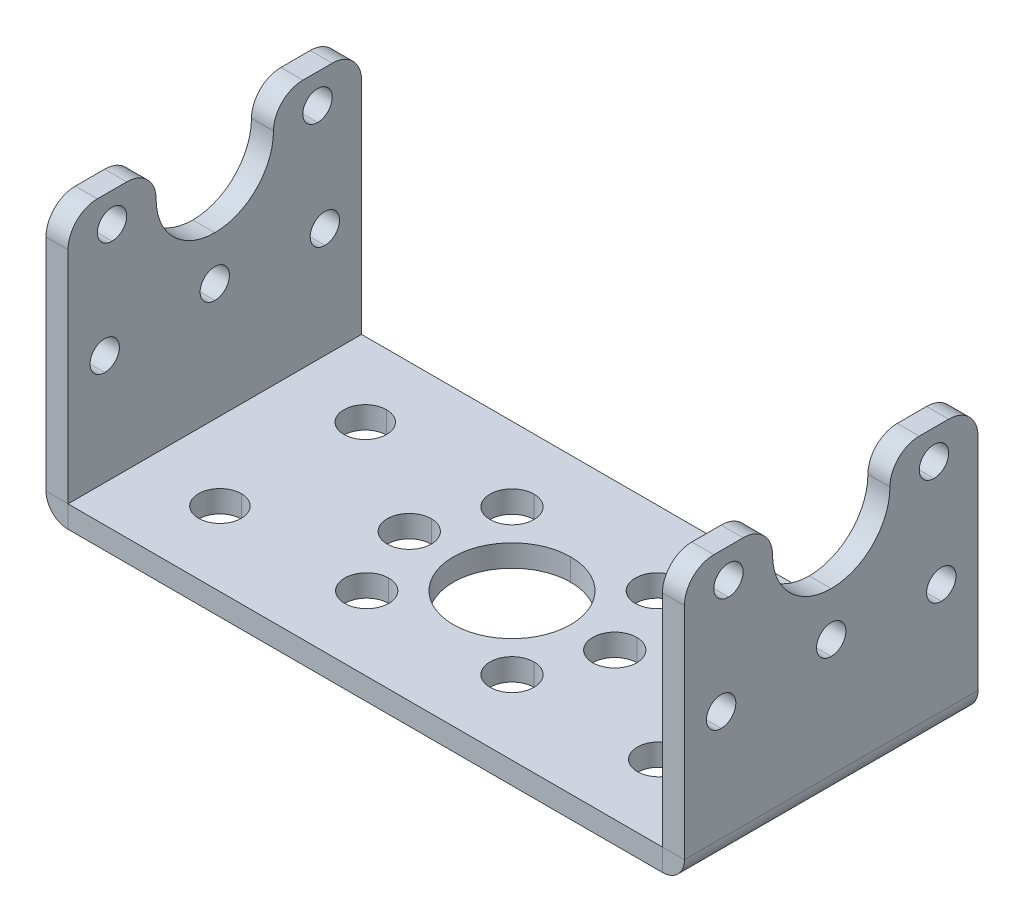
ISO-10303-21;
HEADER;
FILE_DESCRIPTION(('STEP AP214'),'2;1');
FILE_NAME('part.step','',(''),(''),'','','');
FILE_SCHEMA(('AUTOMOTIVE_DESIGN { 1 0 10303 214 1 1 1 1 }'));
ENDSEC;
DATA;
#1=APPLICATION_CONTEXT('core data for automotive mechanical design processes');
#2=APPLICATION_PROTOCOL_DEFINITION('international standard','automotive_design',2000,#1);
#3=PRODUCT_CONTEXT('',#1,'mechanical');
#4=PRODUCT('Part','Part','',(#3));
#5=PRODUCT_RELATED_PRODUCT_CATEGORY('part','',(#4));
#6=PRODUCT_DEFINITION_FORMATION('','',#4);
#7=PRODUCT_DEFINITION_CONTEXT('part definition',#1,'design');
#8=PRODUCT_DEFINITION('design','',#6,#7);
#9=PRODUCT_DEFINITION_SHAPE('','',#8);
#10=(LENGTH_UNIT() NAMED_UNIT(*) SI_UNIT(.MILLI.,.METRE.));
#11=(NAMED_UNIT(*) PLANE_ANGLE_UNIT() SI_UNIT($,.RADIAN.));
#12=(NAMED_UNIT(*) SI_UNIT($,.STERADIAN.) SOLID_ANGLE_UNIT());
#13=UNCERTAINTY_MEASURE_WITH_UNIT(LENGTH_MEASURE(1.E-05),#10,'distance_accuracy_value','');
#14=(GEOMETRIC_REPRESENTATION_CONTEXT(3) GLOBAL_UNCERTAINTY_ASSIGNED_CONTEXT((#13)) GLOBAL_UNIT_ASSIGNED_CONTEXT((#10,
#11,#12)) REPRESENTATION_CONTEXT('',''));
#15=CARTESIAN_POINT('',(0.,0.,0.));
#16=DIRECTION('',(0.,0.,1.));
#17=DIRECTION('',(1.,0.,0.));
#18=AXIS2_PLACEMENT_3D('',#15,#16,#17);
#19=CARTESIAN_POINT('',(21.75,15.,-7.));
#20=DIRECTION('',(-1.,0.,0.));
#21=DIRECTION('',(0.,-1.,0.));
#22=AXIS2_PLACEMENT_3D('',#19,#20,#21);
#23=CYLINDRICAL_SURFACE('',#22,1.);
#24=DIRECTION('',(1.,0.,0.));
#25=VECTOR('',#24,1.);
#26=CARTESIAN_POINT('',(20.25,16.,-7.));
#27=LINE('',#26,#25);
#28=CARTESIAN_POINT('',(20.25,16.,-7.));
#29=VERTEX_POINT('',#28);
#30=CARTESIAN_POINT('',(21.75,16.,-7.));
#31=VERTEX_POINT('',#30);
#32=EDGE_CURVE('E11',#29,#31,#27,.T.);
#33=ORIENTED_EDGE('',*,*,#32,.F.);
#34=CARTESIAN_POINT('',(20.25,15.,-7.));
#35=DIRECTION('',(1.,0.,0.));
#36=DIRECTION('',(0.,-1.,0.));
#37=AXIS2_PLACEMENT_3D('',#34,#35,#36);
#38=CIRCLE('',#37,1.);
#39=CARTESIAN_POINT('',(20.25,14.,-7.));
#40=VERTEX_POINT('',#39);
#41=EDGE_CURVE('E816',#40,#29,#38,.T.);
#42=ORIENTED_EDGE('',*,*,#41,.F.);
#43=DIRECTION('',(1.,0.,0.));
#44=VECTOR('',#43,1.);
#45=CARTESIAN_POINT('',(20.25,14.,-7.));
#46=LINE('',#45,#44);
#47=CARTESIAN_POINT('',(21.75,14.,-7.));
#48=VERTEX_POINT('',#47);
#49=EDGE_CURVE('E28',#40,#48,#46,.T.);
#50=ORIENTED_EDGE('',*,*,#49,.T.);
#51=CARTESIAN_POINT('',(21.75,15.,-7.));
#52=DIRECTION('',(-1.,0.,0.));
#53=DIRECTION('',(0.,1.,0.));
#54=AXIS2_PLACEMENT_3D('',#51,#52,#53);
#55=CIRCLE('',#54,1.);
#56=EDGE_CURVE('E787',#31,#48,#55,.T.);
#57=ORIENTED_EDGE('',*,*,#56,.F.);
#58=EDGE_LOOP('',(#33,#42,#50,#57));
#59=FACE_BOUND('',#58,.T.);
#60=ADVANCED_FACE('F17',(#59),#23,.F.);
#61=CARTESIAN_POINT('',(21.75,15.,-7.));
#62=DIRECTION('',(-1.,0.,0.));
#63=DIRECTION('',(0.,-1.,0.));
#64=AXIS2_PLACEMENT_3D('',#61,#62,#63);
#65=CYLINDRICAL_SURFACE('',#64,1.);
#66=CARTESIAN_POINT('',(21.75,15.,-7.));
#67=DIRECTION('',(-1.,0.,0.));
#68=DIRECTION('',(0.,-1.,0.));
#69=AXIS2_PLACEMENT_3D('',#66,#67,#68);
#70=CIRCLE('',#69,1.);
#71=EDGE_CURVE('E618',#48,#31,#70,.T.);
#72=ORIENTED_EDGE('',*,*,#71,.F.);
#73=ORIENTED_EDGE('',*,*,#49,.F.);
#74=CARTESIAN_POINT('',(20.25,15.,-7.));
#75=DIRECTION('',(1.,0.,0.));
#76=DIRECTION('',(0.,1.,0.));
#77=AXIS2_PLACEMENT_3D('',#74,#75,#76);
#78=CIRCLE('',#77,1.);
#79=EDGE_CURVE('E893',#29,#40,#78,.T.);
#80=ORIENTED_EDGE('',*,*,#79,.F.);
#81=ORIENTED_EDGE('',*,*,#32,.T.);
#82=EDGE_LOOP('',(#72,#73,#80,#81));
#83=FACE_BOUND('',#82,.T.);
#84=ADVANCED_FACE('F1317',(#83),#65,.F.);
#85=CARTESIAN_POINT('',(21.75,8.,0.));
#86=DIRECTION('',(-1.,0.,0.));
#87=DIRECTION('',(0.,-1.,0.));
#88=AXIS2_PLACEMENT_3D('',#85,#86,#87);
#89=CYLINDRICAL_SURFACE('',#88,1.);
#90=DIRECTION('',(1.,0.,0.));
#91=VECTOR('',#90,1.);
#92=CARTESIAN_POINT('',(20.25,9.,0.));
#93=LINE('',#92,#91);
#94=CARTESIAN_POINT('',(20.25,9.,0.));
#95=VERTEX_POINT('',#94);
#96=CARTESIAN_POINT('',(21.75,9.,0.));
#97=VERTEX_POINT('',#96);
#98=EDGE_CURVE('E736',#95,#97,#93,.T.);
#99=ORIENTED_EDGE('',*,*,#98,.F.);
#100=CARTESIAN_POINT('',(20.25,8.,0.));
#101=DIRECTION('',(1.,0.,0.));
#102=DIRECTION('',(0.,-1.,0.));
#103=AXIS2_PLACEMENT_3D('',#100,#101,#102);
#104=CIRCLE('',#103,1.);
#105=CARTESIAN_POINT('',(20.25,7.,0.));
#106=VERTEX_POINT('',#105);
#107=EDGE_CURVE('E817',#106,#95,#104,.T.);
#108=ORIENTED_EDGE('',*,*,#107,.F.);
#109=DIRECTION('',(1.,0.,0.));
#110=VECTOR('',#109,1.);
#111=CARTESIAN_POINT('',(20.25,7.,0.));
#112=LINE('',#111,#110);
#113=CARTESIAN_POINT('',(21.75,7.,0.));
#114=VERTEX_POINT('',#113);
#115=EDGE_CURVE('E807',#106,#114,#112,.T.);
#116=ORIENTED_EDGE('',*,*,#115,.T.);
#117=CARTESIAN_POINT('',(21.75,8.,0.));
#118=DIRECTION('',(-1.,0.,0.));
#119=DIRECTION('',(0.,1.,0.));
#120=AXIS2_PLACEMENT_3D('',#117,#118,#119);
#121=CIRCLE('',#120,1.);
#122=EDGE_CURVE('E1026',#97,#114,#121,.T.);
#123=ORIENTED_EDGE('',*,*,#122,.F.);
#124=EDGE_LOOP('',(#99,#108,#116,#123));
#125=FACE_BOUND('',#124,.T.);
#126=ADVANCED_FACE('F1322',(#125),#89,.F.);
#127=CARTESIAN_POINT('',(21.75,8.,0.));
#128=DIRECTION('',(-1.,0.,0.));
#129=DIRECTION('',(0.,-1.,0.));
#130=AXIS2_PLACEMENT_3D('',#127,#128,#129);
#131=CYLINDRICAL_SURFACE('',#130,1.);
#132=CARTESIAN_POINT('',(21.75,8.,0.));
#133=DIRECTION('',(-1.,0.,0.));
#134=DIRECTION('',(0.,-1.,0.));
#135=AXIS2_PLACEMENT_3D('',#132,#133,#134);
#136=CIRCLE('',#135,1.);
#137=EDGE_CURVE('E791',#114,#97,#136,.T.);
#138=ORIENTED_EDGE('',*,*,#137,.F.);
#139=ORIENTED_EDGE('',*,*,#115,.F.);
#140=CARTESIAN_POINT('',(20.25,8.,0.));
#141=DIRECTION('',(1.,0.,0.));
#142=DIRECTION('',(0.,1.,0.));
#143=AXIS2_PLACEMENT_3D('',#140,#141,#142);
#144=CIRCLE('',#143,1.);
#145=EDGE_CURVE('E812',#95,#106,#144,.T.);
#146=ORIENTED_EDGE('',*,*,#145,.F.);
#147=ORIENTED_EDGE('',*,*,#98,.T.);
#148=EDGE_LOOP('',(#138,#139,#146,#147));
#149=FACE_BOUND('',#148,.T.);
#150=ADVANCED_FACE('F1367',(#149),#131,.F.);
#151=CARTESIAN_POINT('',(21.75,15.,7.));
#152=DIRECTION('',(-1.,0.,0.));
#153=DIRECTION('',(0.,-1.,0.));
#154=AXIS2_PLACEMENT_3D('',#151,#152,#153);
#155=CYLINDRICAL_SURFACE('',#154,1.);
#156=DIRECTION('',(1.,0.,0.));
#157=VECTOR('',#156,1.);
#158=CARTESIAN_POINT('',(20.25,16.,7.));
#159=LINE('',#158,#157);
#160=CARTESIAN_POINT('',(20.25,16.,7.));
#161=VERTEX_POINT('',#160);
#162=CARTESIAN_POINT('',(21.75,16.,7.));
#163=VERTEX_POINT('',#162);
#164=EDGE_CURVE('E786',#161,#163,#159,.T.);
#165=ORIENTED_EDGE('',*,*,#164,.F.);
#166=CARTESIAN_POINT('',(20.25,15.,7.));
#167=DIRECTION('',(1.,0.,0.));
#168=DIRECTION('',(0.,-1.,0.));
#169=AXIS2_PLACEMENT_3D('',#166,#167,#168);
#170=CIRCLE('',#169,1.);
#171=CARTESIAN_POINT('',(20.25,14.,7.));
#172=VERTEX_POINT('',#171);
#173=EDGE_CURVE('E1091',#172,#161,#170,.T.);
#174=ORIENTED_EDGE('',*,*,#173,.F.);
#175=DIRECTION('',(1.,0.,0.));
#176=VECTOR('',#175,1.);
#177=CARTESIAN_POINT('',(20.25,14.,7.));
#178=LINE('',#177,#176);
#179=CARTESIAN_POINT('',(21.75,14.,7.));
#180=VERTEX_POINT('',#179);
#181=EDGE_CURVE('E782',#172,#180,#178,.T.);
#182=ORIENTED_EDGE('',*,*,#181,.T.);
#183=CARTESIAN_POINT('',(21.75,15.,7.));
#184=DIRECTION('',(-1.,0.,0.));
#185=DIRECTION('',(0.,1.,0.));
#186=AXIS2_PLACEMENT_3D('',#183,#184,#185);
#187=CIRCLE('',#186,1.);
#188=EDGE_CURVE('E875',#163,#180,#187,.T.);
#189=ORIENTED_EDGE('',*,*,#188,.F.);
#190=EDGE_LOOP('',(#165,#174,#182,#189));
#191=FACE_BOUND('',#190,.T.);
#192=ADVANCED_FACE('F1363',(#191),#155,.F.);
#193=CARTESIAN_POINT('',(21.75,15.,7.));
#194=DIRECTION('',(-1.,0.,0.));
#195=DIRECTION('',(0.,-1.,0.));
#196=AXIS2_PLACEMENT_3D('',#193,#194,#195);
#197=CYLINDRICAL_SURFACE('',#196,1.);
#198=CARTESIAN_POINT('',(21.75,15.,7.));
#199=DIRECTION('',(-1.,0.,0.));
#200=DIRECTION('',(0.,-1.,0.));
#201=AXIS2_PLACEMENT_3D('',#198,#199,#200);
#202=CIRCLE('',#201,1.);
#203=EDGE_CURVE('E1023',#180,#163,#202,.T.);
#204=ORIENTED_EDGE('',*,*,#203,.F.);
#205=ORIENTED_EDGE('',*,*,#181,.F.);
#206=CARTESIAN_POINT('',(20.25,15.,7.));
#207=DIRECTION('',(1.,0.,0.));
#208=DIRECTION('',(0.,1.,0.));
#209=AXIS2_PLACEMENT_3D('',#206,#207,#208);
#210=CIRCLE('',#209,1.);
#211=EDGE_CURVE('E1087',#161,#172,#210,.T.);
#212=ORIENTED_EDGE('',*,*,#211,.F.);
#213=ORIENTED_EDGE('',*,*,#164,.T.);
#214=EDGE_LOOP('',(#204,#205,#212,#213));
#215=FACE_BOUND('',#214,.T.);
#216=ADVANCED_FACE('F1366',(#215),#197,.F.);
#217=CARTESIAN_POINT('',(-21.75,7.5,-7.5));
#218=DIRECTION('',(1.,0.,0.));
#219=DIRECTION('',(0.,1.,0.));
#220=AXIS2_PLACEMENT_3D('',#217,#218,#219);
#221=CYLINDRICAL_SURFACE('',#220,1.);
#222=CARTESIAN_POINT('',(20.25,7.5,-7.5));
#223=DIRECTION('',(1.,0.,0.));
#224=DIRECTION('',(0.,1.,0.));
#225=AXIS2_PLACEMENT_3D('',#222,#223,#224);
#226=CIRCLE('',#225,1.);
#227=CARTESIAN_POINT('',(20.25,8.5,-7.5));
#228=VERTEX_POINT('',#227);
#229=CARTESIAN_POINT('',(20.25,6.5,-7.5));
#230=VERTEX_POINT('',#229);
#231=EDGE_CURVE('E866',#228,#230,#226,.T.);
#232=ORIENTED_EDGE('',*,*,#231,.F.);
#233=DIRECTION('',(-1.,0.,0.));
#234=VECTOR('',#233,1.);
#235=CARTESIAN_POINT('',(21.75,8.5,-7.5));
#236=LINE('',#235,#234);
#237=CARTESIAN_POINT('',(21.75,8.5,-7.5));
#238=VERTEX_POINT('',#237);
#239=EDGE_CURVE('E536',#238,#228,#236,.T.);
#240=ORIENTED_EDGE('',*,*,#239,.F.);
#241=CARTESIAN_POINT('',(21.75,7.5,-7.5));
#242=DIRECTION('',(-1.,0.,0.));
#243=DIRECTION('',(0.,-1.,0.));
#244=AXIS2_PLACEMENT_3D('',#241,#242,#243);
#245=CIRCLE('',#244,1.);
#246=CARTESIAN_POINT('',(21.75,6.5,-7.5));
#247=VERTEX_POINT('',#246);
#248=EDGE_CURVE('E493',#247,#238,#245,.T.);
#249=ORIENTED_EDGE('',*,*,#248,.F.);
#250=DIRECTION('',(-1.,0.,0.));
#251=VECTOR('',#250,1.);
#252=CARTESIAN_POINT('',(21.75,6.5,-7.5));
#253=LINE('',#252,#251);
#254=EDGE_CURVE('E532',#247,#230,#253,.T.);
#255=ORIENTED_EDGE('',*,*,#254,.T.);
#256=EDGE_LOOP('',(#232,#240,#249,#255));
#257=FACE_BOUND('',#256,.T.);
#258=ADVANCED_FACE('F1415',(#257),#221,.F.);
#259=CARTESIAN_POINT('',(-21.75,7.5,-7.5));
#260=DIRECTION('',(1.,0.,0.));
#261=DIRECTION('',(0.,1.,0.));
#262=AXIS2_PLACEMENT_3D('',#259,#260,#261);
#263=CYLINDRICAL_SURFACE('',#262,1.);
#264=ORIENTED_EDGE('',*,*,#254,.F.);
#265=CARTESIAN_POINT('',(21.75,7.5,-7.5));
#266=DIRECTION('',(-1.,0.,0.));
#267=DIRECTION('',(0.,1.,0.));
#268=AXIS2_PLACEMENT_3D('',#265,#266,#267);
#269=CIRCLE('',#268,1.);
#270=EDGE_CURVE('E871',#238,#247,#269,.T.);
#271=ORIENTED_EDGE('',*,*,#270,.F.);
#272=ORIENTED_EDGE('',*,*,#239,.T.);
#273=CARTESIAN_POINT('',(20.25,7.5,-7.5));
#274=DIRECTION('',(1.,0.,0.));
#275=DIRECTION('',(0.,-1.,0.));
#276=AXIS2_PLACEMENT_3D('',#273,#274,#275);
#277=CIRCLE('',#276,1.);
#278=EDGE_CURVE('E870',#230,#228,#277,.T.);
#279=ORIENTED_EDGE('',*,*,#278,.F.);
#280=EDGE_LOOP('',(#264,#271,#272,#279));
#281=FACE_BOUND('',#280,.T.);
#282=ADVANCED_FACE('F1391',(#281),#263,.F.);
#283=CARTESIAN_POINT('',(-21.75,7.5,7.5));
#284=DIRECTION('',(1.,0.,0.));
#285=DIRECTION('',(0.,1.,0.));
#286=AXIS2_PLACEMENT_3D('',#283,#284,#285);
#287=CYLINDRICAL_SURFACE('',#286,1.);
#288=CARTESIAN_POINT('',(20.25,7.5,7.5));
#289=DIRECTION('',(1.,0.,0.));
#290=DIRECTION('',(0.,1.,0.));
#291=AXIS2_PLACEMENT_3D('',#288,#289,#290);
#292=CIRCLE('',#291,1.);
#293=CARTESIAN_POINT('',(20.25,8.5,7.5));
#294=VERTEX_POINT('',#293);
#295=CARTESIAN_POINT('',(20.25,6.5,7.5));
#296=VERTEX_POINT('',#295);
#297=EDGE_CURVE('E1095',#294,#296,#292,.T.);
#298=ORIENTED_EDGE('',*,*,#297,.F.);
#299=DIRECTION('',(-1.,0.,0.));
#300=VECTOR('',#299,1.);
#301=CARTESIAN_POINT('',(21.75,8.5,7.5));
#302=LINE('',#301,#300);
#303=CARTESIAN_POINT('',(21.75,8.5,7.5));
#304=VERTEX_POINT('',#303);
#305=EDGE_CURVE('E485',#304,#294,#302,.T.);
#306=ORIENTED_EDGE('',*,*,#305,.F.);
#307=CARTESIAN_POINT('',(21.75,7.5,7.5));
#308=DIRECTION('',(-1.,0.,0.));
#309=DIRECTION('',(0.,-1.,0.));
#310=AXIS2_PLACEMENT_3D('',#307,#308,#309);
#311=CIRCLE('',#310,1.);
#312=CARTESIAN_POINT('',(21.75,6.5,7.5));
#313=VERTEX_POINT('',#312);
#314=EDGE_CURVE('E491',#313,#304,#311,.T.);
#315=ORIENTED_EDGE('',*,*,#314,.F.);
#316=DIRECTION('',(-1.,0.,0.));
#317=VECTOR('',#316,1.);
#318=CARTESIAN_POINT('',(21.75,6.5,7.5));
#319=LINE('',#318,#317);
#320=EDGE_CURVE('E473',#313,#296,#319,.T.);
#321=ORIENTED_EDGE('',*,*,#320,.T.);
#322=EDGE_LOOP('',(#298,#306,#315,#321));
#323=FACE_BOUND('',#322,.T.);
#324=ADVANCED_FACE('F495',(#323),#287,.F.);
#325=CARTESIAN_POINT('',(-21.75,7.5,7.5));
#326=DIRECTION('',(1.,0.,0.));
#327=DIRECTION('',(0.,1.,0.));
#328=AXIS2_PLACEMENT_3D('',#325,#326,#327);
#329=CYLINDRICAL_SURFACE('',#328,1.);
#330=ORIENTED_EDGE('',*,*,#320,.F.);
#331=CARTESIAN_POINT('',(21.75,7.5,7.5));
#332=DIRECTION('',(-1.,0.,0.));
#333=DIRECTION('',(0.,1.,0.));
#334=AXIS2_PLACEMENT_3D('',#331,#332,#333);
#335=CIRCLE('',#334,1.);
#336=EDGE_CURVE('E476',#304,#313,#335,.T.);
#337=ORIENTED_EDGE('',*,*,#336,.F.);
#338=ORIENTED_EDGE('',*,*,#305,.T.);
#339=CARTESIAN_POINT('',(20.25,7.5,7.5));
#340=DIRECTION('',(1.,0.,0.));
#341=DIRECTION('',(0.,-1.,0.));
#342=AXIS2_PLACEMENT_3D('',#339,#340,#341);
#343=CIRCLE('',#342,1.);
#344=EDGE_CURVE('E479',#296,#294,#343,.T.);
#345=ORIENTED_EDGE('',*,*,#344,.F.);
#346=EDGE_LOOP('',(#330,#337,#338,#345));
#347=FACE_BOUND('',#346,.T.);
#348=ADVANCED_FACE('F475',(#347),#329,.F.);
#349=CARTESIAN_POINT('',(21.75,15.,-8.));
#350=DIRECTION('',(1.,0.,0.));
#351=DIRECTION('',(0.,1.,0.));
#352=AXIS2_PLACEMENT_3D('',#349,#350,#351);
#353=CYLINDRICAL_SURFACE('',#352,2.);
#354=DIRECTION('',(-1.,0.,0.));
#355=VECTOR('',#354,1.);
#356=CARTESIAN_POINT('',(21.75,15.,-10.));
#357=LINE('',#356,#355);
#358=CARTESIAN_POINT('',(21.75,15.,-10.));
#359=VERTEX_POINT('',#358);
#360=CARTESIAN_POINT('',(20.25,15.,-10.));
#361=VERTEX_POINT('',#360);
#362=EDGE_CURVE('E615',#359,#361,#357,.T.);
#363=ORIENTED_EDGE('',*,*,#362,.T.);
#364=CARTESIAN_POINT('',(20.25,15.,-8.));
#365=DIRECTION('',(-1.,0.,0.));
#366=DIRECTION('',(0.,1.,0.));
#367=AXIS2_PLACEMENT_3D('',#364,#365,#366);
#368=CIRCLE('',#367,2.);
#369=CARTESIAN_POINT('',(20.25,17.,-8.));
#370=VERTEX_POINT('',#369);
#371=EDGE_CURVE('E811',#370,#361,#368,.T.);
#372=ORIENTED_EDGE('',*,*,#371,.F.);
#373=DIRECTION('',(1.,0.,0.));
#374=VECTOR('',#373,1.);
#375=CARTESIAN_POINT('',(20.25,17.,-8.));
#376=LINE('',#375,#374);
#377=CARTESIAN_POINT('',(21.75,17.,-8.));
#378=VERTEX_POINT('',#377);
#379=EDGE_CURVE('E508',#370,#378,#376,.T.);
#380=ORIENTED_EDGE('',*,*,#379,.T.);
#381=CARTESIAN_POINT('',(21.75,15.,-8.));
#382=DIRECTION('',(1.,0.,0.));
#383=DIRECTION('',(0.,0.,-1.));
#384=AXIS2_PLACEMENT_3D('',#381,#382,#383);
#385=CIRCLE('',#384,2.);
#386=EDGE_CURVE('E21',#359,#378,#385,.T.);
#387=ORIENTED_EDGE('',*,*,#386,.F.);
#388=EDGE_LOOP('',(#363,#372,#380,#387));
#389=FACE_BOUND('',#388,.T.);
#390=ADVANCED_FACE('F1135',(#389),#353,.T.);
#391=CARTESIAN_POINT('',(21.75,15.,-6.));
#392=DIRECTION('',(-1.,0.,0.));
#393=DIRECTION('',(0.,-1.,0.));
#394=AXIS2_PLACEMENT_3D('',#391,#392,#393);
#395=CYLINDRICAL_SURFACE('',#394,2.);
#396=DIRECTION('',(-1.,0.,0.));
#397=VECTOR('',#396,1.);
#398=CARTESIAN_POINT('',(21.75,17.,-6.));
#399=LINE('',#398,#397);
#400=CARTESIAN_POINT('',(21.75,17.,-6.));
#401=VERTEX_POINT('',#400);
#402=CARTESIAN_POINT('',(20.25,17.,-6.));
#403=VERTEX_POINT('',#402);
#404=EDGE_CURVE('E645',#401,#403,#399,.T.);
#405=ORIENTED_EDGE('',*,*,#404,.T.);
#406=CARTESIAN_POINT('',(20.25,15.,-6.));
#407=DIRECTION('',(-1.,0.,0.));
#408=DIRECTION('',(0.,0.,1.));
#409=AXIS2_PLACEMENT_3D('',#406,#407,#408);
#410=CIRCLE('',#409,2.);
#411=CARTESIAN_POINT('',(20.25,15.,-4.));
#412=VERTEX_POINT('',#411);
#413=EDGE_CURVE('E1076',#412,#403,#410,.T.);
#414=ORIENTED_EDGE('',*,*,#413,.F.);
#415=DIRECTION('',(1.,0.,0.));
#416=VECTOR('',#415,1.);
#417=CARTESIAN_POINT('',(20.25,15.,-4.));
#418=LINE('',#417,#416);
#419=CARTESIAN_POINT('',(21.75,15.,-4.));
#420=VERTEX_POINT('',#419);
#421=EDGE_CURVE('E486',#412,#420,#418,.T.);
#422=ORIENTED_EDGE('',*,*,#421,.T.);
#423=CARTESIAN_POINT('',(21.75,15.,-6.));
#424=DIRECTION('',(1.,0.,0.));
#425=DIRECTION('',(0.,1.,0.));
#426=AXIS2_PLACEMENT_3D('',#423,#424,#425);
#427=CIRCLE('',#426,2.);
#428=EDGE_CURVE('E541',#401,#420,#427,.T.);
#429=ORIENTED_EDGE('',*,*,#428,.F.);
#430=EDGE_LOOP('',(#405,#414,#422,#429));
#431=FACE_BOUND('',#430,.T.);
#432=ADVANCED_FACE('F1369',(#431),#395,.T.);
#433=CARTESIAN_POINT('',(21.75,15.,0.));
#434=DIRECTION('',(-1.,0.,0.));
#435=DIRECTION('',(0.,-1.,0.));
#436=AXIS2_PLACEMENT_3D('',#433,#434,#435);
#437=CYLINDRICAL_SURFACE('',#436,4.);
#438=CARTESIAN_POINT('',(21.75,15.,0.));
#439=DIRECTION('',(-1.,0.,0.));
#440=DIRECTION('',(0.,0.,-1.));
#441=AXIS2_PLACEMENT_3D('',#438,#439,#440);
#442=CIRCLE('',#441,4.);
#443=CARTESIAN_POINT('',(21.75,11.,0.));
#444=VERTEX_POINT('',#443);
#445=EDGE_CURVE('E545',#420,#444,#442,.T.);
#446=ORIENTED_EDGE('',*,*,#445,.F.);
#447=ORIENTED_EDGE('',*,*,#421,.F.);
#448=CARTESIAN_POINT('',(20.25,15.,0.));
#449=DIRECTION('',(1.,0.,0.));
#450=DIRECTION('',(0.,-1.,0.));
#451=AXIS2_PLACEMENT_3D('',#448,#449,#450);
#452=CIRCLE('',#451,4.);
#453=CARTESIAN_POINT('',(20.25,11.,0.));
#454=VERTEX_POINT('',#453);
#455=EDGE_CURVE('E1021',#454,#412,#452,.T.);
#456=ORIENTED_EDGE('',*,*,#455,.F.);
#457=DIRECTION('',(1.,0.,0.));
#458=VECTOR('',#457,1.);
#459=CARTESIAN_POINT('',(20.25,11.,0.));
#460=LINE('',#459,#458);
#461=EDGE_CURVE('E537',#454,#444,#460,.T.);
#462=ORIENTED_EDGE('',*,*,#461,.T.);
#463=EDGE_LOOP('',(#446,#447,#456,#462));
#464=FACE_BOUND('',#463,.T.);
#465=ADVANCED_FACE('F1353',(#464),#437,.F.);
#466=CARTESIAN_POINT('',(21.75,15.,0.));
#467=DIRECTION('',(-1.,0.,0.));
#468=DIRECTION('',(0.,-1.,0.));
#469=AXIS2_PLACEMENT_3D('',#466,#467,#468);
#470=CYLINDRICAL_SURFACE('',#469,4.);
#471=ORIENTED_EDGE('',*,*,#461,.F.);
#472=CARTESIAN_POINT('',(20.25,15.,0.));
#473=DIRECTION('',(1.,0.,0.));
#474=DIRECTION('',(0.,0.,1.));
#475=AXIS2_PLACEMENT_3D('',#472,#473,#474);
#476=CIRCLE('',#475,4.);
#477=CARTESIAN_POINT('',(20.25,15.,4.));
#478=VERTEX_POINT('',#477);
#479=EDGE_CURVE('E919',#478,#454,#476,.T.);
#480=ORIENTED_EDGE('',*,*,#479,.F.);
#481=DIRECTION('',(-1.,0.,0.));
#482=VECTOR('',#481,1.);
#483=CARTESIAN_POINT('',(21.75,15.,4.));
#484=LINE('',#483,#482);
#485=CARTESIAN_POINT('',(21.75,15.,4.));
#486=VERTEX_POINT('',#485);
#487=EDGE_CURVE('E540',#486,#478,#484,.T.);
#488=ORIENTED_EDGE('',*,*,#487,.F.);
#489=CARTESIAN_POINT('',(21.75,15.,0.));
#490=DIRECTION('',(-1.,0.,0.));
#491=DIRECTION('',(0.,-1.,0.));
#492=AXIS2_PLACEMENT_3D('',#489,#490,#491);
#493=CIRCLE('',#492,4.);
#494=EDGE_CURVE('E549',#444,#486,#493,.T.);
#495=ORIENTED_EDGE('',*,*,#494,.F.);
#496=EDGE_LOOP('',(#471,#480,#488,#495));
#497=FACE_BOUND('',#496,.T.);
#498=ADVANCED_FACE('F1350',(#497),#470,.F.);
#499=CARTESIAN_POINT('',(21.75,15.,6.));
#500=DIRECTION('',(-1.,0.,0.));
#501=DIRECTION('',(0.,-1.,0.));
#502=AXIS2_PLACEMENT_3D('',#499,#500,#501);
#503=CYLINDRICAL_SURFACE('',#502,2.);
#504=DIRECTION('',(1.,0.,0.));
#505=VECTOR('',#504,1.);
#506=CARTESIAN_POINT('',(20.25,17.,6.));
#507=LINE('',#506,#505);
#508=CARTESIAN_POINT('',(20.25,17.,6.));
#509=VERTEX_POINT('',#508);
#510=CARTESIAN_POINT('',(21.75,17.,6.));
#511=VERTEX_POINT('',#510);
#512=EDGE_CURVE('E795',#509,#511,#507,.T.);
#513=ORIENTED_EDGE('',*,*,#512,.T.);
#514=CARTESIAN_POINT('',(21.75,15.,6.));
#515=DIRECTION('',(1.,0.,0.));
#516=DIRECTION('',(0.,0.,-1.));
#517=AXIS2_PLACEMENT_3D('',#514,#515,#516);
#518=CIRCLE('',#517,2.);
#519=EDGE_CURVE('E847',#486,#511,#518,.T.);
#520=ORIENTED_EDGE('',*,*,#519,.F.);
#521=ORIENTED_EDGE('',*,*,#487,.T.);
#522=CARTESIAN_POINT('',(20.25,15.,6.));
#523=DIRECTION('',(-1.,0.,0.));
#524=DIRECTION('',(0.,1.,0.));
#525=AXIS2_PLACEMENT_3D('',#522,#523,#524);
#526=CIRCLE('',#525,2.);
#527=EDGE_CURVE('E826',#509,#478,#526,.T.);
#528=ORIENTED_EDGE('',*,*,#527,.F.);
#529=EDGE_LOOP('',(#513,#520,#521,#528));
#530=FACE_BOUND('',#529,.T.);
#531=ADVANCED_FACE('F19',(#530),#503,.T.);
#532=CARTESIAN_POINT('',(21.75,17.,-20.47928946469));
#533=DIRECTION('',(0.,-1.,0.));
#534=DIRECTION('',(0.,0.,-1.));
#535=AXIS2_PLACEMENT_3D('',#532,#533,#534);
#536=PLANE('',#535);
#537=ORIENTED_EDGE('',*,*,#512,.F.);
#538=DIRECTION('',(0.,0.,-1.));
#539=VECTOR('',#538,1.);
#540=CARTESIAN_POINT('',(20.25,17.,8.));
#541=LINE('',#540,#539);
#542=CARTESIAN_POINT('',(20.25,17.,8.));
#543=VERTEX_POINT('',#542);
#544=EDGE_CURVE('E822',#543,#509,#541,.T.);
#545=ORIENTED_EDGE('',*,*,#544,.F.);
#546=DIRECTION('',(-1.,0.,0.));
#547=VECTOR('',#546,1.);
#548=CARTESIAN_POINT('',(21.75,17.,8.));
#549=LINE('',#548,#547);
#550=CARTESIAN_POINT('',(21.75,17.,8.));
#551=VERTEX_POINT('',#550);
#552=EDGE_CURVE('E1260',#551,#543,#549,.T.);
#553=ORIENTED_EDGE('',*,*,#552,.F.);
#554=DIRECTION('',(0.,0.,-1.));
#555=VECTOR('',#554,1.);
#556=CARTESIAN_POINT('',(21.75,17.,8.));
#557=LINE('',#556,#555);
#558=EDGE_CURVE('E746',#551,#511,#557,.T.);
#559=ORIENTED_EDGE('',*,*,#558,.T.);
#560=EDGE_LOOP('',(#537,#545,#553,#559));
#561=FACE_BOUND('',#560,.T.);
#562=ADVANCED_FACE('F1655',(#561),#536,.F.);
#563=CARTESIAN_POINT('',(21.75,15.,8.));
#564=DIRECTION('',(-1.,0.,0.));
#565=DIRECTION('',(0.,-1.,0.));
#566=AXIS2_PLACEMENT_3D('',#563,#564,#565);
#567=CYLINDRICAL_SURFACE('',#566,2.);
#568=DIRECTION('',(1.,0.,0.));
#569=VECTOR('',#568,1.);
#570=CARTESIAN_POINT('',(20.25,15.,10.));
#571=LINE('',#570,#569);
#572=CARTESIAN_POINT('',(20.25,15.,10.));
#573=VERTEX_POINT('',#572);
#574=CARTESIAN_POINT('',(21.75,15.,10.));
#575=VERTEX_POINT('',#574);
#576=EDGE_CURVE('E1256',#573,#575,#571,.T.);
#577=ORIENTED_EDGE('',*,*,#576,.T.);
#578=CARTESIAN_POINT('',(21.75,15.,8.));
#579=DIRECTION('',(1.,0.,0.));
#580=DIRECTION('',(0.,1.,0.));
#581=AXIS2_PLACEMENT_3D('',#578,#579,#580);
#582=CIRCLE('',#581,2.);
#583=EDGE_CURVE('E741',#551,#575,#582,.T.);
#584=ORIENTED_EDGE('',*,*,#583,.F.);
#585=ORIENTED_EDGE('',*,*,#552,.T.);
#586=CARTESIAN_POINT('',(20.25,15.,8.));
#587=DIRECTION('',(-1.,0.,0.));
#588=DIRECTION('',(0.,0.,1.));
#589=AXIS2_PLACEMENT_3D('',#586,#587,#588);
#590=CIRCLE('',#589,2.);
#591=EDGE_CURVE('E827',#573,#543,#590,.T.);
#592=ORIENTED_EDGE('',*,*,#591,.F.);
#593=EDGE_LOOP('',(#577,#584,#585,#592));
#594=FACE_BOUND('',#593,.T.);
#595=ADVANCED_FACE('F1458',(#594),#567,.T.);
#596=CARTESIAN_POINT('',(21.75,0.,10.));
#597=DIRECTION('',(0.,0.,1.));
#598=DIRECTION('',(1.,0.,0.));
#599=AXIS2_PLACEMENT_3D('',#596,#597,#598);
#600=PLANE('',#599);
#601=ORIENTED_EDGE('',*,*,#576,.F.);
#602=DIRECTION('',(0.,-1.,0.));
#603=VECTOR('',#602,1.);
#604=CARTESIAN_POINT('',(20.25,15.,10.));
#605=LINE('',#604,#603);
#606=CARTESIAN_POINT('',(20.25,0.,10.));
#607=VERTEX_POINT('',#606);
#608=EDGE_CURVE('E1140',#573,#607,#605,.T.);
#609=ORIENTED_EDGE('',*,*,#608,.T.);
#610=DIRECTION('',(1.,0.,0.));
#611=VECTOR('',#610,1.);
#612=CARTESIAN_POINT('',(20.25,0.,10.));
#613=LINE('',#612,#611);
#614=CARTESIAN_POINT('',(21.75,0.,10.));
#615=VERTEX_POINT('',#614);
#616=EDGE_CURVE('E717',#607,#615,#613,.T.);
#617=ORIENTED_EDGE('',*,*,#616,.T.);
#618=DIRECTION('',(0.,-1.,0.));
#619=VECTOR('',#618,1.);
#620=CARTESIAN_POINT('',(21.75,15.,10.));
#621=LINE('',#620,#619);
#622=EDGE_CURVE('E745',#575,#615,#621,.T.);
#623=ORIENTED_EDGE('',*,*,#622,.F.);
#624=EDGE_LOOP('',(#601,#609,#617,#623));
#625=FACE_BOUND('',#624,.T.);
#626=ADVANCED_FACE('F1455',(#625),#600,.T.);
#627=CARTESIAN_POINT('',(21.75,15.,-7.));
#628=DIRECTION('',(-1.,0.,0.));
#629=DIRECTION('',(0.,-1.,0.));
#630=AXIS2_PLACEMENT_3D('',#627,#628,#629);
#631=CYLINDRICAL_SURFACE('',#630,1.);
#632=DIRECTION('',(1.,0.,0.));
#633=VECTOR('',#632,1.);
#634=CARTESIAN_POINT('',(-21.75,16.,-7.));
#635=LINE('',#634,#633);
#636=CARTESIAN_POINT('',(-21.75,16.,-7.));
#637=VERTEX_POINT('',#636);
#638=CARTESIAN_POINT('',(-20.25,16.,-7.));
#639=VERTEX_POINT('',#638);
#640=EDGE_CURVE('E42',#637,#639,#635,.T.);
#641=ORIENTED_EDGE('',*,*,#640,.F.);
#642=CARTESIAN_POINT('',(-21.75,15.,-7.));
#643=DIRECTION('',(1.,0.,0.));
#644=DIRECTION('',(0.,-1.,0.));
#645=AXIS2_PLACEMENT_3D('',#642,#643,#644);
#646=CIRCLE('',#645,1.);
#647=CARTESIAN_POINT('',(-21.75,14.,-7.));
#648=VERTEX_POINT('',#647);
#649=EDGE_CURVE('E911',#648,#637,#646,.T.);
#650=ORIENTED_EDGE('',*,*,#649,.F.);
#651=DIRECTION('',(1.,0.,0.));
#652=VECTOR('',#651,1.);
#653=CARTESIAN_POINT('',(-21.75,14.,-7.));
#654=LINE('',#653,#652);
#655=CARTESIAN_POINT('',(-20.25,14.,-7.));
#656=VERTEX_POINT('',#655);
#657=EDGE_CURVE('E799',#648,#656,#654,.T.);
#658=ORIENTED_EDGE('',*,*,#657,.T.);
#659=CARTESIAN_POINT('',(-20.25,15.,-7.));
#660=DIRECTION('',(-1.,0.,0.));
#661=DIRECTION('',(0.,1.,0.));
#662=AXIS2_PLACEMENT_3D('',#659,#660,#661);
#663=CIRCLE('',#662,1.);
#664=EDGE_CURVE('E762',#639,#656,#663,.T.);
#665=ORIENTED_EDGE('',*,*,#664,.F.);
#666=EDGE_LOOP('',(#641,#650,#658,#665));
#667=FACE_BOUND('',#666,.T.);
#668=ADVANCED_FACE('F1427',(#667),#631,.F.);
#669=CARTESIAN_POINT('',(21.75,15.,-7.));
#670=DIRECTION('',(-1.,0.,0.));
#671=DIRECTION('',(0.,-1.,0.));
#672=AXIS2_PLACEMENT_3D('',#669,#670,#671);
#673=CYLINDRICAL_SURFACE('',#672,1.);
#674=CARTESIAN_POINT('',(-20.25,15.,-7.));
#675=DIRECTION('',(-1.,0.,0.));
#676=DIRECTION('',(0.,-1.,0.));
#677=AXIS2_PLACEMENT_3D('',#674,#675,#676);
#678=CIRCLE('',#677,1.);
#679=EDGE_CURVE('E892',#656,#639,#678,.T.);
#680=ORIENTED_EDGE('',*,*,#679,.F.);
#681=ORIENTED_EDGE('',*,*,#657,.F.);
#682=CARTESIAN_POINT('',(-21.75,15.,-7.));
#683=DIRECTION('',(1.,0.,0.));
#684=DIRECTION('',(0.,1.,0.));
#685=AXIS2_PLACEMENT_3D('',#682,#683,#684);
#686=CIRCLE('',#685,1.);
#687=EDGE_CURVE('E907',#637,#648,#686,.T.);
#688=ORIENTED_EDGE('',*,*,#687,.F.);
#689=ORIENTED_EDGE('',*,*,#640,.T.);
#690=EDGE_LOOP('',(#680,#681,#688,#689));
#691=FACE_BOUND('',#690,.T.);
#692=ADVANCED_FACE('F1398',(#691),#673,.F.);
#693=CARTESIAN_POINT('',(21.75,8.,0.));
#694=DIRECTION('',(-1.,0.,0.));
#695=DIRECTION('',(0.,-1.,0.));
#696=AXIS2_PLACEMENT_3D('',#693,#694,#695);
#697=CYLINDRICAL_SURFACE('',#696,1.);
#698=DIRECTION('',(1.,0.,0.));
#699=VECTOR('',#698,1.);
#700=CARTESIAN_POINT('',(-21.75,9.,0.));
#701=LINE('',#700,#699);
#702=CARTESIAN_POINT('',(-21.75,9.,0.));
#703=VERTEX_POINT('',#702);
#704=CARTESIAN_POINT('',(-20.25,9.,0.));
#705=VERTEX_POINT('',#704);
#706=EDGE_CURVE('E803',#703,#705,#701,.T.);
#707=ORIENTED_EDGE('',*,*,#706,.F.);
#708=CARTESIAN_POINT('',(-21.75,8.,0.));
#709=DIRECTION('',(1.,0.,0.));
#710=DIRECTION('',(0.,-1.,0.));
#711=AXIS2_PLACEMENT_3D('',#708,#709,#710);
#712=CIRCLE('',#711,1.);
#713=CARTESIAN_POINT('',(-21.75,7.,0.));
#714=VERTEX_POINT('',#713);
#715=EDGE_CURVE('E1051',#714,#703,#712,.T.);
#716=ORIENTED_EDGE('',*,*,#715,.F.);
#717=DIRECTION('',(1.,0.,0.));
#718=VECTOR('',#717,1.);
#719=CARTESIAN_POINT('',(-21.75,7.,0.));
#720=LINE('',#719,#718);
#721=CARTESIAN_POINT('',(-20.25,7.,0.));
#722=VERTEX_POINT('',#721);
#723=EDGE_CURVE('E1046',#714,#722,#720,.T.);
#724=ORIENTED_EDGE('',*,*,#723,.T.);
#725=CARTESIAN_POINT('',(-20.25,8.,0.));
#726=DIRECTION('',(-1.,0.,0.));
#727=DIRECTION('',(0.,1.,0.));
#728=AXIS2_PLACEMENT_3D('',#725,#726,#727);
#729=CIRCLE('',#728,1.);
#730=EDGE_CURVE('E763',#705,#722,#729,.T.);
#731=ORIENTED_EDGE('',*,*,#730,.F.);
#732=EDGE_LOOP('',(#707,#716,#724,#731));
#733=FACE_BOUND('',#732,.T.);
#734=ADVANCED_FACE('F1394',(#733),#697,.F.);
#735=CARTESIAN_POINT('',(21.75,8.,0.));
#736=DIRECTION('',(-1.,0.,0.));
#737=DIRECTION('',(0.,-1.,0.));
#738=AXIS2_PLACEMENT_3D('',#735,#736,#737);
#739=CYLINDRICAL_SURFACE('',#738,1.);
#740=CARTESIAN_POINT('',(-20.25,8.,0.));
#741=DIRECTION('',(-1.,0.,0.));
#742=DIRECTION('',(0.,-1.,0.));
#743=AXIS2_PLACEMENT_3D('',#740,#741,#742);
#744=CIRCLE('',#743,1.);
#745=EDGE_CURVE('E758',#722,#705,#744,.T.);
#746=ORIENTED_EDGE('',*,*,#745,.F.);
#747=ORIENTED_EDGE('',*,*,#723,.F.);
#748=CARTESIAN_POINT('',(-21.75,8.,0.));
#749=DIRECTION('',(1.,0.,0.));
#750=DIRECTION('',(0.,1.,0.));
#751=AXIS2_PLACEMENT_3D('',#748,#749,#750);
#752=CIRCLE('',#751,1.);
#753=EDGE_CURVE('E1047',#703,#714,#752,.T.);
#754=ORIENTED_EDGE('',*,*,#753,.F.);
#755=ORIENTED_EDGE('',*,*,#706,.T.);
#756=EDGE_LOOP('',(#746,#747,#754,#755));
#757=FACE_BOUND('',#756,.T.);
#758=ADVANCED_FACE('F1397',(#757),#739,.F.);
#759=CARTESIAN_POINT('',(21.75,15.,7.));
#760=DIRECTION('',(-1.,0.,0.));
#761=DIRECTION('',(0.,-1.,0.));
#762=AXIS2_PLACEMENT_3D('',#759,#760,#761);
#763=CYLINDRICAL_SURFACE('',#762,1.);
#764=DIRECTION('',(1.,0.,0.));
#765=VECTOR('',#764,1.);
#766=CARTESIAN_POINT('',(-21.75,16.,7.));
#767=LINE('',#766,#765);
#768=CARTESIAN_POINT('',(-21.75,16.,7.));
#769=VERTEX_POINT('',#768);
#770=CARTESIAN_POINT('',(-20.25,16.,7.));
#771=VERTEX_POINT('',#770);
#772=EDGE_CURVE('E1111',#769,#771,#767,.T.);
#773=ORIENTED_EDGE('',*,*,#772,.F.);
#774=CARTESIAN_POINT('',(-21.75,15.,7.));
#775=DIRECTION('',(1.,0.,0.));
#776=DIRECTION('',(0.,-1.,0.));
#777=AXIS2_PLACEMENT_3D('',#774,#775,#776);
#778=CIRCLE('',#777,1.);
#779=CARTESIAN_POINT('',(-21.75,14.,7.));
#780=VERTEX_POINT('',#779);
#781=EDGE_CURVE('E764',#780,#769,#778,.T.);
#782=ORIENTED_EDGE('',*,*,#781,.F.);
#783=DIRECTION('',(1.,0.,0.));
#784=VECTOR('',#783,1.);
#785=CARTESIAN_POINT('',(-21.75,14.,7.));
#786=LINE('',#785,#784);
#787=CARTESIAN_POINT('',(-20.25,14.,7.));
#788=VERTEX_POINT('',#787);
#789=EDGE_CURVE('E1114',#780,#788,#786,.T.);
#790=ORIENTED_EDGE('',*,*,#789,.T.);
#791=CARTESIAN_POINT('',(-20.25,15.,7.));
#792=DIRECTION('',(-1.,0.,0.));
#793=DIRECTION('',(0.,1.,0.));
#794=AXIS2_PLACEMENT_3D('',#791,#792,#793);
#795=CIRCLE('',#794,1.);
#796=EDGE_CURVE('E673',#771,#788,#795,.T.);
#797=ORIENTED_EDGE('',*,*,#796,.F.);
#798=EDGE_LOOP('',(#773,#782,#790,#797));
#799=FACE_BOUND('',#798,.T.);
#800=ADVANCED_FACE('F1404',(#799),#763,.F.);
#801=CARTESIAN_POINT('',(21.75,15.,7.));
#802=DIRECTION('',(-1.,0.,0.));
#803=DIRECTION('',(0.,-1.,0.));
#804=AXIS2_PLACEMENT_3D('',#801,#802,#803);
#805=CYLINDRICAL_SURFACE('',#804,1.);
#806=CARTESIAN_POINT('',(-20.25,15.,7.));
#807=DIRECTION('',(-1.,0.,0.));
#808=DIRECTION('',(0.,-1.,0.));
#809=AXIS2_PLACEMENT_3D('',#806,#807,#808);
#810=CIRCLE('',#809,1.);
#811=EDGE_CURVE('E677',#788,#771,#810,.T.);
#812=ORIENTED_EDGE('',*,*,#811,.F.);
#813=ORIENTED_EDGE('',*,*,#789,.F.);
#814=CARTESIAN_POINT('',(-21.75,15.,7.));
#815=DIRECTION('',(1.,0.,0.));
#816=DIRECTION('',(0.,1.,0.));
#817=AXIS2_PLACEMENT_3D('',#814,#815,#816);
#818=CIRCLE('',#817,1.);
#819=EDGE_CURVE('E768',#769,#780,#818,.T.);
#820=ORIENTED_EDGE('',*,*,#819,.F.);
#821=ORIENTED_EDGE('',*,*,#772,.T.);
#822=EDGE_LOOP('',(#812,#813,#820,#821));
#823=FACE_BOUND('',#822,.T.);
#824=ADVANCED_FACE('F1407',(#823),#805,.F.);
#825=CARTESIAN_POINT('',(-21.75,7.5,-7.5));
#826=DIRECTION('',(1.,0.,0.));
#827=DIRECTION('',(0.,1.,0.));
#828=AXIS2_PLACEMENT_3D('',#825,#826,#827);
#829=CYLINDRICAL_SURFACE('',#828,1.);
#830=DIRECTION('',(-1.,0.,0.));
#831=VECTOR('',#830,1.);
#832=CARTESIAN_POINT('',(-20.25,6.5,-7.5));
#833=LINE('',#832,#831);
#834=CARTESIAN_POINT('',(-20.25,6.5,-7.5));
#835=VERTEX_POINT('',#834);
#836=CARTESIAN_POINT('',(-21.75,6.5,-7.5));
#837=VERTEX_POINT('',#836);
#838=EDGE_CURVE('E592',#835,#837,#833,.T.);
#839=ORIENTED_EDGE('',*,*,#838,.F.);
#840=CARTESIAN_POINT('',(-20.25,7.5,-7.5));
#841=DIRECTION('',(-1.,0.,0.));
#842=DIRECTION('',(0.,1.,0.));
#843=AXIS2_PLACEMENT_3D('',#840,#841,#842);
#844=CIRCLE('',#843,1.);
#845=CARTESIAN_POINT('',(-20.25,8.5,-7.5));
#846=VERTEX_POINT('',#845);
#847=EDGE_CURVE('E678',#846,#835,#844,.T.);
#848=ORIENTED_EDGE('',*,*,#847,.F.);
#849=DIRECTION('',(-1.,0.,0.));
#850=VECTOR('',#849,1.);
#851=CARTESIAN_POINT('',(-20.25,8.5,-7.5));
#852=LINE('',#851,#850);
#853=CARTESIAN_POINT('',(-21.75,8.5,-7.5));
#854=VERTEX_POINT('',#853);
#855=EDGE_CURVE('E589',#846,#854,#852,.T.);
#856=ORIENTED_EDGE('',*,*,#855,.T.);
#857=CARTESIAN_POINT('',(-21.75,7.5,-7.5));
#858=DIRECTION('',(1.,0.,0.));
#859=DIRECTION('',(0.,-1.,0.));
#860=AXIS2_PLACEMENT_3D('',#857,#858,#859);
#861=CIRCLE('',#860,1.);
#862=EDGE_CURVE('E859',#837,#854,#861,.T.);
#863=ORIENTED_EDGE('',*,*,#862,.F.);
#864=EDGE_LOOP('',(#839,#848,#856,#863));
#865=FACE_BOUND('',#864,.T.);
#866=ADVANCED_FACE('F1461',(#865),#829,.F.);
#867=CARTESIAN_POINT('',(-21.75,7.5,-7.5));
#868=DIRECTION('',(1.,0.,0.));
#869=DIRECTION('',(0.,1.,0.));
#870=AXIS2_PLACEMENT_3D('',#867,#868,#869);
#871=CYLINDRICAL_SURFACE('',#870,1.);
#872=CARTESIAN_POINT('',(-21.75,7.5,-7.5));
#873=DIRECTION('',(1.,0.,0.));
#874=DIRECTION('',(0.,1.,0.));
#875=AXIS2_PLACEMENT_3D('',#872,#873,#874);
#876=CIRCLE('',#875,1.);
#877=EDGE_CURVE('E769',#854,#837,#876,.T.);
#878=ORIENTED_EDGE('',*,*,#877,.F.);
#879=ORIENTED_EDGE('',*,*,#855,.F.);
#880=CARTESIAN_POINT('',(-20.25,7.5,-7.5));
#881=DIRECTION('',(-1.,0.,0.));
#882=DIRECTION('',(0.,-1.,0.));
#883=AXIS2_PLACEMENT_3D('',#880,#881,#882);
#884=CIRCLE('',#883,1.);
#885=EDGE_CURVE('E946',#835,#846,#884,.T.);
#886=ORIENTED_EDGE('',*,*,#885,.F.);
#887=ORIENTED_EDGE('',*,*,#838,.T.);
#888=EDGE_LOOP('',(#878,#879,#886,#887));
#889=FACE_BOUND('',#888,.T.);
#890=ADVANCED_FACE('F1439',(#889),#871,.F.);
#891=CARTESIAN_POINT('',(-21.75,7.5,7.5));
#892=DIRECTION('',(1.,0.,0.));
#893=DIRECTION('',(0.,1.,0.));
#894=AXIS2_PLACEMENT_3D('',#891,#892,#893);
#895=CYLINDRICAL_SURFACE('',#894,1.);
#896=DIRECTION('',(-1.,0.,0.));
#897=VECTOR('',#896,1.);
#898=CARTESIAN_POINT('',(-20.25,6.5,7.5));
#899=LINE('',#898,#897);
#900=CARTESIAN_POINT('',(-20.25,6.5,7.5));
#901=VERTEX_POINT('',#900);
#902=CARTESIAN_POINT('',(-21.75,6.5,7.5));
#903=VERTEX_POINT('',#902);
#904=EDGE_CURVE('E593',#901,#903,#899,.T.);
#905=ORIENTED_EDGE('',*,*,#904,.F.);
#906=CARTESIAN_POINT('',(-20.25,7.5,7.5));
#907=DIRECTION('',(-1.,0.,0.));
#908=DIRECTION('',(0.,1.,0.));
#909=AXIS2_PLACEMENT_3D('',#906,#907,#908);
#910=CIRCLE('',#909,1.);
#911=CARTESIAN_POINT('',(-20.25,8.5,7.5));
#912=VERTEX_POINT('',#911);
#913=EDGE_CURVE('E715',#912,#901,#910,.T.);
#914=ORIENTED_EDGE('',*,*,#913,.F.);
#915=DIRECTION('',(-1.,0.,0.));
#916=VECTOR('',#915,1.);
#917=CARTESIAN_POINT('',(-20.25,8.5,7.5));
#918=LINE('',#917,#916);
#919=CARTESIAN_POINT('',(-21.75,8.5,7.5));
#920=VERTEX_POINT('',#919);
#921=EDGE_CURVE('E636',#912,#920,#918,.T.);
#922=ORIENTED_EDGE('',*,*,#921,.T.);
#923=CARTESIAN_POINT('',(-21.75,7.5,7.5));
#924=DIRECTION('',(1.,0.,0.));
#925=DIRECTION('',(0.,-1.,0.));
#926=AXIS2_PLACEMENT_3D('',#923,#924,#925);
#927=CIRCLE('',#926,1.);
#928=EDGE_CURVE('E524',#903,#920,#927,.T.);
#929=ORIENTED_EDGE('',*,*,#928,.F.);
#930=EDGE_LOOP('',(#905,#914,#922,#929));
#931=FACE_BOUND('',#930,.T.);
#932=ADVANCED_FACE('F1436',(#931),#895,.F.);
#933=CARTESIAN_POINT('',(-21.75,7.5,7.5));
#934=DIRECTION('',(1.,0.,0.));
#935=DIRECTION('',(0.,1.,0.));
#936=AXIS2_PLACEMENT_3D('',#933,#934,#935);
#937=CYLINDRICAL_SURFACE('',#936,1.);
#938=CARTESIAN_POINT('',(-21.75,7.5,7.5));
#939=DIRECTION('',(1.,0.,0.));
#940=DIRECTION('',(0.,1.,0.));
#941=AXIS2_PLACEMENT_3D('',#938,#939,#940);
#942=CIRCLE('',#941,1.);
#943=EDGE_CURVE('E640',#920,#903,#942,.T.);
#944=ORIENTED_EDGE('',*,*,#943,.F.);
#945=ORIENTED_EDGE('',*,*,#921,.F.);
#946=CARTESIAN_POINT('',(-20.25,7.5,7.5));
#947=DIRECTION('',(-1.,0.,0.));
#948=DIRECTION('',(0.,-1.,0.));
#949=AXIS2_PLACEMENT_3D('',#946,#947,#948);
#950=CIRCLE('',#949,1.);
#951=EDGE_CURVE('E711',#901,#912,#950,.T.);
#952=ORIENTED_EDGE('',*,*,#951,.F.);
#953=ORIENTED_EDGE('',*,*,#904,.T.);
#954=EDGE_LOOP('',(#944,#945,#952,#953));
#955=FACE_BOUND('',#954,.T.);
#956=ADVANCED_FACE('F1438',(#955),#937,.F.);
#957=CARTESIAN_POINT('',(21.75,15.,8.));
#958=DIRECTION('',(-1.,0.,0.));
#959=DIRECTION('',(0.,-1.,0.));
#960=AXIS2_PLACEMENT_3D('',#957,#958,#959);
#961=CYLINDRICAL_SURFACE('',#960,2.);
#962=DIRECTION('',(1.,0.,0.));
#963=VECTOR('',#962,1.);
#964=CARTESIAN_POINT('',(-21.75,15.,10.));
#965=LINE('',#964,#963);
#966=CARTESIAN_POINT('',(-21.75,15.,10.));
#967=VERTEX_POINT('',#966);
#968=CARTESIAN_POINT('',(-20.25,15.,10.));
#969=VERTEX_POINT('',#968);
#970=EDGE_CURVE('E883',#967,#969,#965,.T.);
#971=ORIENTED_EDGE('',*,*,#970,.T.);
#972=CARTESIAN_POINT('',(-20.25,15.,8.));
#973=DIRECTION('',(1.,0.,0.));
#974=DIRECTION('',(0.,1.,0.));
#975=AXIS2_PLACEMENT_3D('',#972,#973,#974);
#976=CIRCLE('',#975,2.);
#977=CARTESIAN_POINT('',(-20.25,17.,8.));
#978=VERTEX_POINT('',#977);
#979=EDGE_CURVE('E556',#978,#969,#976,.T.);
#980=ORIENTED_EDGE('',*,*,#979,.F.);
#981=DIRECTION('',(-1.,0.,0.));
#982=VECTOR('',#981,1.);
#983=CARTESIAN_POINT('',(-20.25,17.,8.));
#984=LINE('',#983,#982);
#985=CARTESIAN_POINT('',(-21.75,17.,8.));
#986=VERTEX_POINT('',#985);
#987=EDGE_CURVE('E888',#978,#986,#984,.T.);
#988=ORIENTED_EDGE('',*,*,#987,.T.);
#989=CARTESIAN_POINT('',(-21.75,15.,8.));
#990=DIRECTION('',(-1.,0.,0.));
#991=DIRECTION('',(0.,0.,1.));
#992=AXIS2_PLACEMENT_3D('',#989,#990,#991);
#993=CIRCLE('',#992,2.);
#994=EDGE_CURVE('E576',#967,#986,#993,.T.);
#995=ORIENTED_EDGE('',*,*,#994,.F.);
#996=EDGE_LOOP('',(#971,#980,#988,#995));
#997=FACE_BOUND('',#996,.T.);
#998=ADVANCED_FACE('F1377',(#997),#961,.T.);
#999=CARTESIAN_POINT('',(21.75,15.,6.));
#1000=DIRECTION('',(-1.,0.,0.));
#1001=DIRECTION('',(0.,-1.,0.));
#1002=AXIS2_PLACEMENT_3D('',#999,#1000,#1001);
#1003=CYLINDRICAL_SURFACE('',#1002,2.);
#1004=DIRECTION('',(1.,0.,0.));
#1005=VECTOR('',#1004,1.);
#1006=CARTESIAN_POINT('',(-21.75,17.,6.));
#1007=LINE('',#1006,#1005);
#1008=CARTESIAN_POINT('',(-21.75,17.,6.));
#1009=VERTEX_POINT('',#1008);
#1010=CARTESIAN_POINT('',(-20.25,17.,6.));
#1011=VERTEX_POINT('',#1010);
#1012=EDGE_CURVE('E577',#1009,#1011,#1007,.T.);
#1013=ORIENTED_EDGE('',*,*,#1012,.T.);
#1014=CARTESIAN_POINT('',(-20.25,15.,6.));
#1015=DIRECTION('',(1.,0.,0.));
#1016=DIRECTION('',(0.,0.,-1.));
#1017=AXIS2_PLACEMENT_3D('',#1014,#1015,#1016);
#1018=CIRCLE('',#1017,2.);
#1019=CARTESIAN_POINT('',(-20.25,15.,4.));
#1020=VERTEX_POINT('',#1019);
#1021=EDGE_CURVE('E737',#1020,#1011,#1018,.T.);
#1022=ORIENTED_EDGE('',*,*,#1021,.F.);
#1023=DIRECTION('',(-1.,0.,0.));
#1024=VECTOR('',#1023,1.);
#1025=CARTESIAN_POINT('',(-20.25,15.,4.));
#1026=LINE('',#1025,#1024);
#1027=CARTESIAN_POINT('',(-21.75,15.,4.));
#1028=VERTEX_POINT('',#1027);
#1029=EDGE_CURVE('E725',#1020,#1028,#1026,.T.);
#1030=ORIENTED_EDGE('',*,*,#1029,.T.);
#1031=CARTESIAN_POINT('',(-21.75,15.,6.));
#1032=DIRECTION('',(-1.,0.,0.));
#1033=DIRECTION('',(0.,1.,0.));
#1034=AXIS2_PLACEMENT_3D('',#1031,#1032,#1033);
#1035=CIRCLE('',#1034,2.);
#1036=EDGE_CURVE('E679',#1009,#1028,#1035,.T.);
#1037=ORIENTED_EDGE('',*,*,#1036,.F.);
#1038=EDGE_LOOP('',(#1013,#1022,#1030,#1037));
#1039=FACE_BOUND('',#1038,.T.);
#1040=ADVANCED_FACE('F1373',(#1039),#1003,.T.);
#1041=CARTESIAN_POINT('',(21.75,15.,0.));
#1042=DIRECTION('',(-1.,0.,0.));
#1043=DIRECTION('',(0.,-1.,0.));
#1044=AXIS2_PLACEMENT_3D('',#1041,#1042,#1043);
#1045=CYLINDRICAL_SURFACE('',#1044,4.);
#1046=DIRECTION('',(1.,0.,0.));
#1047=VECTOR('',#1046,1.);
#1048=CARTESIAN_POINT('',(-21.75,11.,0.));
#1049=LINE('',#1048,#1047);
#1050=CARTESIAN_POINT('',(-21.75,11.,0.));
#1051=VERTEX_POINT('',#1050);
#1052=CARTESIAN_POINT('',(-20.25,11.,0.));
#1053=VERTEX_POINT('',#1052);
#1054=EDGE_CURVE('E729',#1051,#1053,#1049,.T.);
#1055=ORIENTED_EDGE('',*,*,#1054,.F.);
#1056=CARTESIAN_POINT('',(-21.75,15.,0.));
#1057=DIRECTION('',(1.,0.,0.));
#1058=DIRECTION('',(0.,0.,1.));
#1059=AXIS2_PLACEMENT_3D('',#1056,#1057,#1058);
#1060=CIRCLE('',#1059,4.);
#1061=EDGE_CURVE('E683',#1028,#1051,#1060,.T.);
#1062=ORIENTED_EDGE('',*,*,#1061,.F.);
#1063=ORIENTED_EDGE('',*,*,#1029,.F.);
#1064=CARTESIAN_POINT('',(-20.25,15.,0.));
#1065=DIRECTION('',(-1.,0.,0.));
#1066=DIRECTION('',(0.,-1.,0.));
#1067=AXIS2_PLACEMENT_3D('',#1064,#1065,#1066);
#1068=CIRCLE('',#1067,4.);
#1069=EDGE_CURVE('E660',#1053,#1020,#1068,.T.);
#1070=ORIENTED_EDGE('',*,*,#1069,.F.);
#1071=EDGE_LOOP('',(#1055,#1062,#1063,#1070));
#1072=FACE_BOUND('',#1071,.T.);
#1073=ADVANCED_FACE('F1376',(#1072),#1045,.F.);
#1074=CARTESIAN_POINT('',(21.75,15.,0.));
#1075=DIRECTION('',(-1.,0.,0.));
#1076=DIRECTION('',(0.,-1.,0.));
#1077=AXIS2_PLACEMENT_3D('',#1074,#1075,#1076);
#1078=CYLINDRICAL_SURFACE('',#1077,4.);
#1079=CARTESIAN_POINT('',(-20.25,15.,0.));
#1080=DIRECTION('',(-1.,0.,0.));
#1081=DIRECTION('',(0.,0.,-1.));
#1082=AXIS2_PLACEMENT_3D('',#1079,#1080,#1081);
#1083=CIRCLE('',#1082,4.);
#1084=CARTESIAN_POINT('',(-20.25,15.,-4.));
#1085=VERTEX_POINT('',#1084);
#1086=EDGE_CURVE('E656',#1085,#1053,#1083,.T.);
#1087=ORIENTED_EDGE('',*,*,#1086,.F.);
#1088=DIRECTION('',(1.,0.,0.));
#1089=VECTOR('',#1088,1.);
#1090=CARTESIAN_POINT('',(-21.75,15.,-4.));
#1091=LINE('',#1090,#1089);
#1092=CARTESIAN_POINT('',(-21.75,15.,-4.));
#1093=VERTEX_POINT('',#1092);
#1094=EDGE_CURVE('E1083',#1093,#1085,#1091,.T.);
#1095=ORIENTED_EDGE('',*,*,#1094,.F.);
#1096=CARTESIAN_POINT('',(-21.75,15.,0.));
#1097=DIRECTION('',(1.,0.,0.));
#1098=DIRECTION('',(0.,-1.,0.));
#1099=AXIS2_PLACEMENT_3D('',#1096,#1097,#1098);
#1100=CIRCLE('',#1099,4.);
#1101=EDGE_CURVE('E599',#1051,#1093,#1100,.T.);
#1102=ORIENTED_EDGE('',*,*,#1101,.F.);
#1103=ORIENTED_EDGE('',*,*,#1054,.T.);
#1104=EDGE_LOOP('',(#1087,#1095,#1102,#1103));
#1105=FACE_BOUND('',#1104,.T.);
#1106=ADVANCED_FACE('F1358',(#1105),#1078,.F.);
#1107=CARTESIAN_POINT('',(21.75,15.,-6.));
#1108=DIRECTION('',(-1.,0.,0.));
#1109=DIRECTION('',(0.,-1.,0.));
#1110=AXIS2_PLACEMENT_3D('',#1107,#1108,#1109);
#1111=CYLINDRICAL_SURFACE('',#1110,2.);
#1112=DIRECTION('',(-1.,0.,0.));
#1113=VECTOR('',#1112,1.);
#1114=CARTESIAN_POINT('',(-20.25,17.,-6.));
#1115=LINE('',#1114,#1113);
#1116=CARTESIAN_POINT('',(-20.25,17.,-6.));
#1117=VERTEX_POINT('',#1116);
#1118=CARTESIAN_POINT('',(-21.75,17.,-6.));
#1119=VERTEX_POINT('',#1118);
#1120=EDGE_CURVE('E687',#1117,#1119,#1115,.T.);
#1121=ORIENTED_EDGE('',*,*,#1120,.T.);
#1122=CARTESIAN_POINT('',(-21.75,15.,-6.));
#1123=DIRECTION('',(-1.,0.,0.));
#1124=DIRECTION('',(0.,0.,1.));
#1125=AXIS2_PLACEMENT_3D('',#1122,#1123,#1124);
#1126=CIRCLE('',#1125,2.);
#1127=EDGE_CURVE('E594',#1093,#1119,#1126,.T.);
#1128=ORIENTED_EDGE('',*,*,#1127,.F.);
#1129=ORIENTED_EDGE('',*,*,#1094,.T.);
#1130=CARTESIAN_POINT('',(-20.25,15.,-6.));
#1131=DIRECTION('',(1.,0.,0.));
#1132=DIRECTION('',(0.,1.,0.));
#1133=AXIS2_PLACEMENT_3D('',#1130,#1131,#1132);
#1134=CIRCLE('',#1133,2.);
#1135=EDGE_CURVE('E587',#1117,#1085,#1134,.T.);
#1136=ORIENTED_EDGE('',*,*,#1135,.F.);
#1137=EDGE_LOOP('',(#1121,#1128,#1129,#1136));
#1138=FACE_BOUND('',#1137,.T.);
#1139=ADVANCED_FACE('F1355',(#1138),#1111,.T.);
#1140=CARTESIAN_POINT('',(21.75,17.,-20.47928946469));
#1141=DIRECTION('',(0.,-1.,0.));
#1142=DIRECTION('',(0.,0.,-1.));
#1143=AXIS2_PLACEMENT_3D('',#1140,#1141,#1142);
#1144=PLANE('',#1143);
#1145=ORIENTED_EDGE('',*,*,#1120,.F.);
#1146=DIRECTION('',(0.,0.,-1.));
#1147=VECTOR('',#1146,1.);
#1148=CARTESIAN_POINT('',(-20.25,17.,-6.));
#1149=LINE('',#1148,#1147);
#1150=CARTESIAN_POINT('',(-20.25,17.,-8.));
#1151=VERTEX_POINT('',#1150);
#1152=EDGE_CURVE('E583',#1117,#1151,#1149,.T.);
#1153=ORIENTED_EDGE('',*,*,#1152,.T.);
#1154=DIRECTION('',(1.,0.,0.));
#1155=VECTOR('',#1154,1.);
#1156=CARTESIAN_POINT('',(-21.75,17.,-8.));
#1157=LINE('',#1156,#1155);
#1158=CARTESIAN_POINT('',(-21.75,17.,-8.));
#1159=VERTEX_POINT('',#1158);
#1160=EDGE_CURVE('E684',#1159,#1151,#1157,.T.);
#1161=ORIENTED_EDGE('',*,*,#1160,.F.);
#1162=DIRECTION('',(0.,0.,-1.));
#1163=VECTOR('',#1162,1.);
#1164=CARTESIAN_POINT('',(-21.75,17.,-6.));
#1165=LINE('',#1164,#1163);
#1166=EDGE_CURVE('E598',#1119,#1159,#1165,.T.);
#1167=ORIENTED_EDGE('',*,*,#1166,.F.);
#1168=EDGE_LOOP('',(#1145,#1153,#1161,#1167));
#1169=FACE_BOUND('',#1168,.T.);
#1170=ADVANCED_FACE('F1343',(#1169),#1144,.F.);
#1171=CARTESIAN_POINT('',(21.75,15.,-8.));
#1172=DIRECTION('',(1.,0.,0.));
#1173=DIRECTION('',(0.,1.,0.));
#1174=AXIS2_PLACEMENT_3D('',#1171,#1172,#1173);
#1175=CYLINDRICAL_SURFACE('',#1174,2.);
#1176=DIRECTION('',(-1.,0.,0.));
#1177=VECTOR('',#1176,1.);
#1178=CARTESIAN_POINT('',(-20.25,15.,-10.));
#1179=LINE('',#1178,#1177);
#1180=CARTESIAN_POINT('',(-20.25,15.,-10.));
#1181=VERTEX_POINT('',#1180);
#1182=CARTESIAN_POINT('',(-21.75,15.,-10.));
#1183=VERTEX_POINT('',#1182);
#1184=EDGE_CURVE('E688',#1181,#1183,#1179,.T.);
#1185=ORIENTED_EDGE('',*,*,#1184,.T.);
#1186=CARTESIAN_POINT('',(-21.75,15.,-8.));
#1187=DIRECTION('',(-1.,0.,0.));
#1188=DIRECTION('',(0.,1.,0.));
#1189=AXIS2_PLACEMENT_3D('',#1186,#1187,#1188);
#1190=CIRCLE('',#1189,2.);
#1191=EDGE_CURVE('E525',#1159,#1183,#1190,.T.);
#1192=ORIENTED_EDGE('',*,*,#1191,.F.);
#1193=ORIENTED_EDGE('',*,*,#1160,.T.);
#1194=CARTESIAN_POINT('',(-20.25,15.,-8.));
#1195=DIRECTION('',(1.,0.,0.));
#1196=DIRECTION('',(0.,0.,-1.));
#1197=AXIS2_PLACEMENT_3D('',#1194,#1195,#1196);
#1198=CIRCLE('',#1197,2.);
#1199=EDGE_CURVE('E588',#1181,#1151,#1198,.T.);
#1200=ORIENTED_EDGE('',*,*,#1199,.F.);
#1201=EDGE_LOOP('',(#1185,#1192,#1193,#1200));
#1202=FACE_BOUND('',#1201,.T.);
#1203=ADVANCED_FACE('F1339',(#1202),#1175,.T.);
#1204=CARTESIAN_POINT('',(-21.75,25.,-10.));
#1205=DIRECTION('',(0.,0.,-1.));
#1206=DIRECTION('',(0.,-1.,0.));
#1207=AXIS2_PLACEMENT_3D('',#1204,#1205,#1206);
#1208=PLANE('',#1207);
#1209=ORIENTED_EDGE('',*,*,#1184,.F.);
#1210=DIRECTION('',(0.,-1.,0.));
#1211=VECTOR('',#1210,1.);
#1212=CARTESIAN_POINT('',(-20.25,15.,-10.));
#1213=LINE('',#1212,#1211);
#1214=CARTESIAN_POINT('',(-20.25,0.,-10.));
#1215=VERTEX_POINT('',#1214);
#1216=EDGE_CURVE('E276',#1181,#1215,#1213,.T.);
#1217=ORIENTED_EDGE('',*,*,#1216,.T.);
#1218=DIRECTION('',(-1.,0.,0.));
#1219=VECTOR('',#1218,1.);
#1220=CARTESIAN_POINT('',(-20.25,0.,-10.));
#1221=LINE('',#1220,#1219);
#1222=CARTESIAN_POINT('',(-21.75,0.,-10.));
#1223=VERTEX_POINT('',#1222);
#1224=EDGE_CURVE('E864',#1215,#1223,#1221,.T.);
#1225=ORIENTED_EDGE('',*,*,#1224,.T.);
#1226=DIRECTION('',(0.,-1.,0.));
#1227=VECTOR('',#1226,1.);
#1228=CARTESIAN_POINT('',(-21.75,15.,-10.));
#1229=LINE('',#1228,#1227);
#1230=EDGE_CURVE('E521',#1183,#1223,#1229,.T.);
#1231=ORIENTED_EDGE('',*,*,#1230,.F.);
#1232=EDGE_LOOP('',(#1209,#1217,#1225,#1231));
#1233=FACE_BOUND('',#1232,.T.);
#1234=ADVANCED_FACE('F1342',(#1233),#1208,.T.);
#1235=CARTESIAN_POINT('',(-21.75,0.,0.));
#1236=DIRECTION('',(-1.,0.,0.));
#1237=DIRECTION('',(0.,0.,1.));
#1238=AXIS2_PLACEMENT_3D('',#1235,#1236,#1237);
#1239=PLANE('',#1238);
#1240=ORIENTED_EDGE('',*,*,#649,.T.);
#1241=ORIENTED_EDGE('',*,*,#687,.T.);
#1242=EDGE_LOOP('',(#1240,#1241));
#1243=FACE_BOUND('',#1242,.T.);
#1244=ORIENTED_EDGE('',*,*,#715,.T.);
#1245=ORIENTED_EDGE('',*,*,#753,.T.);
#1246=EDGE_LOOP('',(#1244,#1245));
#1247=FACE_BOUND('',#1246,.T.);
#1248=ORIENTED_EDGE('',*,*,#781,.T.);
#1249=ORIENTED_EDGE('',*,*,#819,.T.);
#1250=EDGE_LOOP('',(#1248,#1249));
#1251=FACE_BOUND('',#1250,.T.);
#1252=ORIENTED_EDGE('',*,*,#862,.T.);
#1253=ORIENTED_EDGE('',*,*,#877,.T.);
#1254=EDGE_LOOP('',(#1252,#1253));
#1255=FACE_BOUND('',#1254,.T.);
#1256=ORIENTED_EDGE('',*,*,#928,.T.);
#1257=ORIENTED_EDGE('',*,*,#943,.T.);
#1258=EDGE_LOOP('',(#1256,#1257));
#1259=FACE_BOUND('',#1258,.T.);
#1260=ORIENTED_EDGE('',*,*,#994,.T.);
#1261=DIRECTION('',(0.,0.,-1.));
#1262=VECTOR('',#1261,1.);
#1263=CARTESIAN_POINT('',(-21.75,17.,8.));
#1264=LINE('',#1263,#1262);
#1265=EDGE_CURVE('E572',#986,#1009,#1264,.T.);
#1266=ORIENTED_EDGE('',*,*,#1265,.T.);
#1267=ORIENTED_EDGE('',*,*,#1036,.T.);
#1268=ORIENTED_EDGE('',*,*,#1061,.T.);
#1269=ORIENTED_EDGE('',*,*,#1101,.T.);
#1270=ORIENTED_EDGE('',*,*,#1127,.T.);
#1271=ORIENTED_EDGE('',*,*,#1166,.T.);
#1272=ORIENTED_EDGE('',*,*,#1191,.T.);
#1273=ORIENTED_EDGE('',*,*,#1230,.T.);
#1274=DIRECTION('',(0.,0.,-1.));
#1275=VECTOR('',#1274,1.);
#1276=CARTESIAN_POINT('',(-21.75,0.,10.));
#1277=LINE('',#1276,#1275);
#1278=CARTESIAN_POINT('',(-21.75,0.,10.));
#1279=VERTEX_POINT('',#1278);
#1280=EDGE_CURVE('E865',#1279,#1223,#1277,.T.);
#1281=ORIENTED_EDGE('',*,*,#1280,.F.);
#1282=DIRECTION('',(0.,1.,0.));
#1283=VECTOR('',#1282,1.);
#1284=CARTESIAN_POINT('',(-21.75,0.,10.));
#1285=LINE('',#1284,#1283);
#1286=EDGE_CURVE('E754',#1279,#967,#1285,.T.);
#1287=ORIENTED_EDGE('',*,*,#1286,.T.);
#1288=EDGE_LOOP('',(#1260,#1266,#1267,#1268,#1269,#1270,#1271,#1272,#1273,#1281,#1287));
#1289=FACE_BOUND('',#1288,.T.);
#1290=ADVANCED_FACE('F1411',(#1243,#1247,#1251,#1255,#1259,#1289),#1239,.T.);
#1291=CARTESIAN_POINT('',(21.75,17.,-20.47928946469));
#1292=DIRECTION('',(0.,-1.,0.));
#1293=DIRECTION('',(0.,0.,-1.));
#1294=AXIS2_PLACEMENT_3D('',#1291,#1292,#1293);
#1295=PLANE('',#1294);
#1296=ORIENTED_EDGE('',*,*,#987,.F.);
#1297=DIRECTION('',(0.,0.,-1.));
#1298=VECTOR('',#1297,1.);
#1299=CARTESIAN_POINT('',(-20.25,17.,8.));
#1300=LINE('',#1299,#1298);
#1301=EDGE_CURVE('E716',#978,#1011,#1300,.T.);
#1302=ORIENTED_EDGE('',*,*,#1301,.T.);
#1303=ORIENTED_EDGE('',*,*,#1012,.F.);
#1304=ORIENTED_EDGE('',*,*,#1265,.F.);
#1305=EDGE_LOOP('',(#1296,#1302,#1303,#1304));
#1306=FACE_BOUND('',#1305,.T.);
#1307=ADVANCED_FACE('F1408',(#1306),#1295,.F.);
#1308=CARTESIAN_POINT('',(-20.25,0.,0.));
#1309=DIRECTION('',(-1.,0.,0.));
#1310=DIRECTION('',(0.,0.,1.));
#1311=AXIS2_PLACEMENT_3D('',#1308,#1309,#1310);
#1312=PLANE('',#1311);
#1313=ORIENTED_EDGE('',*,*,#664,.T.);
#1314=ORIENTED_EDGE('',*,*,#679,.T.);
#1315=EDGE_LOOP('',(#1313,#1314));
#1316=FACE_BOUND('',#1315,.T.);
#1317=ORIENTED_EDGE('',*,*,#730,.T.);
#1318=ORIENTED_EDGE('',*,*,#745,.T.);
#1319=EDGE_LOOP('',(#1317,#1318));
#1320=FACE_BOUND('',#1319,.T.);
#1321=ORIENTED_EDGE('',*,*,#796,.T.);
#1322=ORIENTED_EDGE('',*,*,#811,.T.);
#1323=EDGE_LOOP('',(#1321,#1322));
#1324=FACE_BOUND('',#1323,.T.);
#1325=ORIENTED_EDGE('',*,*,#885,.T.);
#1326=ORIENTED_EDGE('',*,*,#847,.T.);
#1327=EDGE_LOOP('',(#1325,#1326));
#1328=FACE_BOUND('',#1327,.T.);
#1329=ORIENTED_EDGE('',*,*,#951,.T.);
#1330=ORIENTED_EDGE('',*,*,#913,.T.);
#1331=EDGE_LOOP('',(#1329,#1330));
#1332=FACE_BOUND('',#1331,.T.);
#1333=ORIENTED_EDGE('',*,*,#979,.T.);
#1334=DIRECTION('',(0.,1.,0.));
#1335=VECTOR('',#1334,1.);
#1336=CARTESIAN_POINT('',(-20.25,0.,10.));
#1337=LINE('',#1336,#1335);
#1338=CARTESIAN_POINT('',(-20.25,0.,10.));
#1339=VERTEX_POINT('',#1338);
#1340=EDGE_CURVE('E560',#1339,#969,#1337,.T.);
#1341=ORIENTED_EDGE('',*,*,#1340,.F.);
#1342=DIRECTION('',(0.,0.,-1.));
#1343=VECTOR('',#1342,1.);
#1344=CARTESIAN_POINT('',(-20.25,0.,10.));
#1345=LINE('',#1344,#1343);
#1346=EDGE_CURVE('E578',#1339,#1215,#1345,.T.);
#1347=ORIENTED_EDGE('',*,*,#1346,.T.);
#1348=ORIENTED_EDGE('',*,*,#1216,.F.);
#1349=ORIENTED_EDGE('',*,*,#1199,.T.);
#1350=ORIENTED_EDGE('',*,*,#1152,.F.);
#1351=ORIENTED_EDGE('',*,*,#1135,.T.);
#1352=ORIENTED_EDGE('',*,*,#1086,.T.);
#1353=ORIENTED_EDGE('',*,*,#1069,.T.);
#1354=ORIENTED_EDGE('',*,*,#1021,.T.);
#1355=ORIENTED_EDGE('',*,*,#1301,.F.);
#1356=EDGE_LOOP('',(#1333,#1341,#1347,#1348,#1349,#1350,#1351,#1352,#1353,#1354,#1355));
#1357=FACE_BOUND('',#1356,.T.);
#1358=ADVANCED_FACE('F1331',(#1316,#1320,#1324,#1328,#1332,#1357),#1312,.F.);
#1359=CARTESIAN_POINT('',(-21.75,0.,10.));
#1360=DIRECTION('',(0.,0.,1.));
#1361=DIRECTION('',(1.,0.,0.));
#1362=AXIS2_PLACEMENT_3D('',#1359,#1360,#1361);
#1363=PLANE('',#1362);
#1364=ORIENTED_EDGE('',*,*,#970,.F.);
#1365=ORIENTED_EDGE('',*,*,#1286,.F.);
#1366=DIRECTION('',(-1.,0.,0.));
#1367=VECTOR('',#1366,1.);
#1368=CARTESIAN_POINT('',(-20.25,0.,10.));
#1369=LINE('',#1368,#1367);
#1370=EDGE_CURVE('E879',#1339,#1279,#1369,.T.);
#1371=ORIENTED_EDGE('',*,*,#1370,.F.);
#1372=ORIENTED_EDGE('',*,*,#1340,.T.);
#1373=EDGE_LOOP('',(#1364,#1365,#1371,#1372));
#1374=FACE_BOUND('',#1373,.T.);
#1375=ADVANCED_FACE('F1327',(#1374),#1363,.T.);
#1376=CARTESIAN_POINT('',(-20.25,-1.5,10.));
#1377=DIRECTION('',(0.,0.,1.));
#1378=DIRECTION('',(1.,0.,0.));
#1379=AXIS2_PLACEMENT_3D('',#1376,#1377,#1378);
#1380=PLANE('',#1379);
#1381=DIRECTION('',(0.,-1.,0.));
#1382=VECTOR('',#1381,1.);
#1383=CARTESIAN_POINT('',(-20.25,0.,10.));
#1384=LINE('',#1383,#1382);
#1385=CARTESIAN_POINT('',(-20.25,-1.5,10.));
#1386=VERTEX_POINT('',#1385);
#1387=EDGE_CURVE('E1057',#1339,#1386,#1384,.T.);
#1388=ORIENTED_EDGE('',*,*,#1387,.F.);
#1389=ORIENTED_EDGE('',*,*,#1370,.T.);
#1390=CARTESIAN_POINT('',(-20.25,0.,10.));
#1391=DIRECTION('',(0.,0.,1.));
#1392=DIRECTION('',(-1.,0.,0.));
#1393=AXIS2_PLACEMENT_3D('',#1390,#1391,#1392);
#1394=CIRCLE('',#1393,1.5);
#1395=EDGE_CURVE('E633',#1279,#1386,#1394,.T.);
#1396=ORIENTED_EDGE('',*,*,#1395,.T.);
#1397=EDGE_LOOP('',(#1388,#1389,#1396));
#1398=FACE_BOUND('',#1397,.T.);
#1399=ADVANCED_FACE('F1330',(#1398),#1380,.T.);
#1400=CARTESIAN_POINT('',(0.,1.5,0.));
#1401=DIRECTION('',(0.,-1.,0.));
#1402=DIRECTION('',(0.,0.,-1.));
#1403=AXIS2_PLACEMENT_3D('',#1400,#1401,#1402);
#1404=CYLINDRICAL_SURFACE('',#1403,4.);
#1405=DIRECTION('',(0.,1.,0.));
#1406=VECTOR('',#1405,1.);
#1407=CARTESIAN_POINT('',(0.,-1.5,4.));
#1408=LINE('',#1407,#1406);
#1409=CARTESIAN_POINT('',(0.,-1.5,4.));
#1410=VERTEX_POINT('',#1409);
#1411=CARTESIAN_POINT('',(0.,0.,4.));
#1412=VERTEX_POINT('',#1411);
#1413=EDGE_CURVE('E884',#1410,#1412,#1408,.T.);
#1414=ORIENTED_EDGE('',*,*,#1413,.F.);
#1415=CARTESIAN_POINT('',(0.,-1.5,0.));
#1416=DIRECTION('',(0.,1.,0.));
#1417=DIRECTION('',(0.,0.,-1.));
#1418=AXIS2_PLACEMENT_3D('',#1415,#1416,#1417);
#1419=CIRCLE('',#1418,4.);
#1420=CARTESIAN_POINT('',(0.,-1.5,-4.));
#1421=VERTEX_POINT('',#1420);
#1422=EDGE_CURVE('E920',#1421,#1410,#1419,.T.);
#1423=ORIENTED_EDGE('',*,*,#1422,.F.);
#1424=DIRECTION('',(0.,1.,0.));
#1425=VECTOR('',#1424,1.);
#1426=CARTESIAN_POINT('',(0.,-1.5,-4.));
#1427=LINE('',#1426,#1425);
#1428=CARTESIAN_POINT('',(0.,0.,-4.));
#1429=VERTEX_POINT('',#1428);
#1430=EDGE_CURVE('E950',#1421,#1429,#1427,.T.);
#1431=ORIENTED_EDGE('',*,*,#1430,.T.);
#1432=CARTESIAN_POINT('',(0.,0.,0.));
#1433=DIRECTION('',(0.,-1.,0.));
#1434=DIRECTION('',(0.,0.,1.));
#1435=AXIS2_PLACEMENT_3D('',#1432,#1433,#1434);
#1436=CIRCLE('',#1435,4.);
#1437=EDGE_CURVE('E689',#1412,#1429,#1436,.T.);
#1438=ORIENTED_EDGE('',*,*,#1437,.F.);
#1439=EDGE_LOOP('',(#1414,#1423,#1431,#1438));
#1440=FACE_BOUND('',#1439,.T.);
#1441=ADVANCED_FACE('F1483',(#1440),#1404,.F.);
#1442=CARTESIAN_POINT('',(0.,1.5,0.));
#1443=DIRECTION('',(0.,-1.,0.));
#1444=DIRECTION('',(0.,0.,-1.));
#1445=AXIS2_PLACEMENT_3D('',#1442,#1443,#1444);
#1446=CYLINDRICAL_SURFACE('',#1445,4.);
#1447=CARTESIAN_POINT('',(0.,0.,0.));
#1448=DIRECTION('',(0.,-1.,0.));
#1449=DIRECTION('',(0.,0.,-1.));
#1450=AXIS2_PLACEMENT_3D('',#1447,#1448,#1449);
#1451=CIRCLE('',#1450,4.);
#1452=EDGE_CURVE('E693',#1429,#1412,#1451,.T.);
#1453=ORIENTED_EDGE('',*,*,#1452,.F.);
#1454=ORIENTED_EDGE('',*,*,#1430,.F.);
#1455=CARTESIAN_POINT('',(0.,-1.5,0.));
#1456=DIRECTION('',(0.,1.,0.));
#1457=DIRECTION('',(0.,0.,1.));
#1458=AXIS2_PLACEMENT_3D('',#1455,#1456,#1457);
#1459=CIRCLE('',#1458,4.);
#1460=EDGE_CURVE('E565',#1410,#1421,#1459,.T.);
#1461=ORIENTED_EDGE('',*,*,#1460,.F.);
#1462=ORIENTED_EDGE('',*,*,#1413,.T.);
#1463=EDGE_LOOP('',(#1453,#1454,#1461,#1462));
#1464=FACE_BOUND('',#1463,.T.);
#1465=ADVANCED_FACE('F1450',(#1464),#1446,.F.);
#1466=CARTESIAN_POINT('',(-4.949747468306,8.5,4.949747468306));
#1467=DIRECTION('',(0.,-1.,0.));
#1468=DIRECTION('',(0.,0.,-1.));
#1469=AXIS2_PLACEMENT_3D('',#1466,#1467,#1468);
#1470=CYLINDRICAL_SURFACE('',#1469,1.5);
#1471=DIRECTION('',(0.,1.,0.));
#1472=VECTOR('',#1471,1.);
#1473=CARTESIAN_POINT('',(-4.949747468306,-1.5,6.449747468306));
#1474=LINE('',#1473,#1472);
#1475=CARTESIAN_POINT('',(-4.949747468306,-1.5,6.449747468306));
#1476=VERTEX_POINT('',#1475);
#1477=CARTESIAN_POINT('',(-4.949747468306,0.,6.449747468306));
#1478=VERTEX_POINT('',#1477);
#1479=EDGE_CURVE('E709',#1476,#1478,#1474,.T.);
#1480=ORIENTED_EDGE('',*,*,#1479,.F.);
#1481=CARTESIAN_POINT('',(-4.949747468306,-1.5,4.949747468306));
#1482=DIRECTION('',(0.,1.,0.));
#1483=DIRECTION('',(0.,0.,-1.));
#1484=AXIS2_PLACEMENT_3D('',#1481,#1482,#1483);
#1485=CIRCLE('',#1484,1.5);
#1486=CARTESIAN_POINT('',(-4.949747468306,-1.5,3.449747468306));
#1487=VERTEX_POINT('',#1486);
#1488=EDGE_CURVE('E570',#1487,#1476,#1485,.T.);
#1489=ORIENTED_EDGE('',*,*,#1488,.F.);
#1490=DIRECTION('',(0.,1.,0.));
#1491=VECTOR('',#1490,1.);
#1492=CARTESIAN_POINT('',(-4.949747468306,-1.5,3.449747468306));
#1493=LINE('',#1492,#1491);
#1494=CARTESIAN_POINT('',(-4.949747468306,0.,3.449747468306));
#1495=VERTEX_POINT('',#1494);
#1496=EDGE_CURVE('E705',#1487,#1495,#1493,.T.);
#1497=ORIENTED_EDGE('',*,*,#1496,.T.);
#1498=CARTESIAN_POINT('',(-4.949747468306,0.,4.949747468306));
#1499=DIRECTION('',(0.,-1.,0.));
#1500=DIRECTION('',(0.,0.,1.));
#1501=AXIS2_PLACEMENT_3D('',#1498,#1499,#1500);
#1502=CIRCLE('',#1501,1.5);
#1503=EDGE_CURVE('E770',#1478,#1495,#1502,.T.);
#1504=ORIENTED_EDGE('',*,*,#1503,.F.);
#1505=EDGE_LOOP('',(#1480,#1489,#1497,#1504));
#1506=FACE_BOUND('',#1505,.T.);
#1507=ADVANCED_FACE('F1423',(#1506),#1470,.F.);
#1508=CARTESIAN_POINT('',(-4.949747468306,8.5,4.949747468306));
#1509=DIRECTION('',(0.,-1.,0.));
#1510=DIRECTION('',(0.,0.,-1.));
#1511=AXIS2_PLACEMENT_3D('',#1508,#1509,#1510);
#1512=CYLINDRICAL_SURFACE('',#1511,1.5);
#1513=CARTESIAN_POINT('',(-4.949747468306,0.,4.949747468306));
#1514=DIRECTION('',(0.,-1.,0.));
#1515=DIRECTION('',(0.,0.,-1.));
#1516=AXIS2_PLACEMENT_3D('',#1513,#1514,#1515);
#1517=CIRCLE('',#1516,1.5);
#1518=EDGE_CURVE('E694',#1495,#1478,#1517,.T.);
#1519=ORIENTED_EDGE('',*,*,#1518,.F.);
#1520=ORIENTED_EDGE('',*,*,#1496,.F.);
#1521=CARTESIAN_POINT('',(-4.949747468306,-1.5,4.949747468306));
#1522=DIRECTION('',(0.,1.,0.));
#1523=DIRECTION('',(0.,0.,1.));
#1524=AXIS2_PLACEMENT_3D('',#1521,#1522,#1523);
#1525=CIRCLE('',#1524,1.5);
#1526=EDGE_CURVE('E923',#1476,#1487,#1525,.T.);
#1527=ORIENTED_EDGE('',*,*,#1526,.F.);
#1528=ORIENTED_EDGE('',*,*,#1479,.T.);
#1529=EDGE_LOOP('',(#1519,#1520,#1527,#1528));
#1530=FACE_BOUND('',#1529,.T.);
#1531=ADVANCED_FACE('F1419',(#1530),#1512,.F.);
#1532=CARTESIAN_POINT('',(4.949747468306,8.5,4.949747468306));
#1533=DIRECTION('',(0.,-1.,0.));
#1534=DIRECTION('',(0.,0.,-1.));
#1535=AXIS2_PLACEMENT_3D('',#1532,#1533,#1534);
#1536=CYLINDRICAL_SURFACE('',#1535,1.5);
#1537=DIRECTION('',(0.,1.,0.));
#1538=VECTOR('',#1537,1.);
#1539=CARTESIAN_POINT('',(4.949747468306,-1.5,6.449747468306));
#1540=LINE('',#1539,#1538);
#1541=CARTESIAN_POINT('',(4.949747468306,-1.5,6.449747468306));
#1542=VERTEX_POINT('',#1541);
#1543=CARTESIAN_POINT('',(4.949747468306,0.,6.449747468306));
#1544=VERTEX_POINT('',#1543);
#1545=EDGE_CURVE('E710',#1542,#1544,#1540,.T.);
#1546=ORIENTED_EDGE('',*,*,#1545,.F.);
#1547=CARTESIAN_POINT('',(4.949747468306,-1.5,4.949747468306));
#1548=DIRECTION('',(0.,1.,0.));
#1549=DIRECTION('',(0.,0.,-1.));
#1550=AXIS2_PLACEMENT_3D('',#1547,#1548,#1549);
#1551=CIRCLE('',#1550,1.5);
#1552=CARTESIAN_POINT('',(4.949747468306,-1.5,3.449747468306));
#1553=VERTEX_POINT('',#1552);
#1554=EDGE_CURVE('E571',#1553,#1542,#1551,.T.);
#1555=ORIENTED_EDGE('',*,*,#1554,.F.);
#1556=DIRECTION('',(0.,1.,0.));
#1557=VECTOR('',#1556,1.);
#1558=CARTESIAN_POINT('',(4.949747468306,-1.5,3.449747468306));
#1559=LINE('',#1558,#1557);
#1560=CARTESIAN_POINT('',(4.949747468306,0.,3.449747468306));
#1561=VERTEX_POINT('',#1560);
#1562=EDGE_CURVE('E830',#1553,#1561,#1559,.T.);
#1563=ORIENTED_EDGE('',*,*,#1562,.T.);
#1564=CARTESIAN_POINT('',(4.949747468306,0.,4.949747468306));
#1565=DIRECTION('',(0.,-1.,0.));
#1566=DIRECTION('',(0.,0.,1.));
#1567=AXIS2_PLACEMENT_3D('',#1564,#1565,#1566);
#1568=CIRCLE('',#1567,1.5);
#1569=EDGE_CURVE('E513',#1544,#1561,#1568,.T.);
#1570=ORIENTED_EDGE('',*,*,#1569,.F.);
#1571=EDGE_LOOP('',(#1546,#1555,#1563,#1570));
#1572=FACE_BOUND('',#1571,.T.);
#1573=ADVANCED_FACE('F1422',(#1572),#1536,.F.);
#1574=CARTESIAN_POINT('',(4.949747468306,8.5,4.949747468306));
#1575=DIRECTION('',(0.,-1.,0.));
#1576=DIRECTION('',(0.,0.,-1.));
#1577=AXIS2_PLACEMENT_3D('',#1574,#1575,#1576);
#1578=CYLINDRICAL_SURFACE('',#1577,1.5);
#1579=CARTESIAN_POINT('',(4.949747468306,0.,4.949747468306));
#1580=DIRECTION('',(0.,-1.,0.));
#1581=DIRECTION('',(0.,0.,-1.));
#1582=AXIS2_PLACEMENT_3D('',#1579,#1580,#1581);
#1583=CIRCLE('',#1582,1.5);
#1584=EDGE_CURVE('E774',#1561,#1544,#1583,.T.);
#1585=ORIENTED_EDGE('',*,*,#1584,.F.);
#1586=ORIENTED_EDGE('',*,*,#1562,.F.);
#1587=CARTESIAN_POINT('',(4.949747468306,-1.5,4.949747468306));
#1588=DIRECTION('',(0.,1.,0.));
#1589=DIRECTION('',(0.,0.,1.));
#1590=AXIS2_PLACEMENT_3D('',#1587,#1588,#1589);
#1591=CIRCLE('',#1590,1.5);
#1592=EDGE_CURVE('E566',#1542,#1553,#1591,.T.);
#1593=ORIENTED_EDGE('',*,*,#1592,.F.);
#1594=ORIENTED_EDGE('',*,*,#1545,.T.);
#1595=EDGE_LOOP('',(#1585,#1586,#1593,#1594));
#1596=FACE_BOUND('',#1595,.T.);
#1597=ADVANCED_FACE('F1494',(#1596),#1578,.F.);
#1598=CARTESIAN_POINT('',(4.949747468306,8.5,-4.949747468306));
#1599=DIRECTION('',(0.,-1.,0.));
#1600=DIRECTION('',(0.,0.,-1.));
#1601=AXIS2_PLACEMENT_3D('',#1598,#1599,#1600);
#1602=CYLINDRICAL_SURFACE('',#1601,1.5);
#1603=DIRECTION('',(0.,1.,0.));
#1604=VECTOR('',#1603,1.);
#1605=CARTESIAN_POINT('',(4.949747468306,-1.5,-3.449747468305));
#1606=LINE('',#1605,#1604);
#1607=CARTESIAN_POINT('',(4.949747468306,-1.5,-3.449747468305));
#1608=VERTEX_POINT('',#1607);
#1609=CARTESIAN_POINT('',(4.949747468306,0.,-3.449747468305));
#1610=VERTEX_POINT('',#1609);
#1611=EDGE_CURVE('E836',#1608,#1610,#1606,.T.);
#1612=ORIENTED_EDGE('',*,*,#1611,.F.);
#1613=CARTESIAN_POINT('',(4.949747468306,-1.5,-4.949747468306));
#1614=DIRECTION('',(0.,1.,0.));
#1615=DIRECTION('',(0.,0.,-1.));
#1616=AXIS2_PLACEMENT_3D('',#1613,#1614,#1615);
#1617=CIRCLE('',#1616,1.5);
#1618=CARTESIAN_POINT('',(4.949747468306,-1.5,-6.449747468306));
#1619=VERTEX_POINT('',#1618);
#1620=EDGE_CURVE('E550',#1619,#1608,#1617,.T.);
#1621=ORIENTED_EDGE('',*,*,#1620,.F.);
#1622=DIRECTION('',(0.,1.,0.));
#1623=VECTOR('',#1622,1.);
#1624=CARTESIAN_POINT('',(4.949747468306,-1.5,-6.449747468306));
#1625=LINE('',#1624,#1623);
#1626=CARTESIAN_POINT('',(4.949747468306,0.,-6.449747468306));
#1627=VERTEX_POINT('',#1626);
#1628=EDGE_CURVE('E850',#1619,#1627,#1625,.T.);
#1629=ORIENTED_EDGE('',*,*,#1628,.T.);
#1630=CARTESIAN_POINT('',(4.949747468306,0.,-4.949747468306));
#1631=DIRECTION('',(0.,-1.,0.));
#1632=DIRECTION('',(0.,0.,1.));
#1633=AXIS2_PLACEMENT_3D('',#1630,#1631,#1632);
#1634=CIRCLE('',#1633,1.5);
#1635=EDGE_CURVE('E514',#1610,#1627,#1634,.T.);
#1636=ORIENTED_EDGE('',*,*,#1635,.F.);
#1637=EDGE_LOOP('',(#1612,#1621,#1629,#1636));
#1638=FACE_BOUND('',#1637,.T.);
#1639=ADVANCED_FACE('F961',(#1638),#1602,.F.);
#1640=CARTESIAN_POINT('',(4.949747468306,8.5,-4.949747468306));
#1641=DIRECTION('',(0.,-1.,0.));
#1642=DIRECTION('',(0.,0.,-1.));
#1643=AXIS2_PLACEMENT_3D('',#1640,#1641,#1642);
#1644=CYLINDRICAL_SURFACE('',#1643,1.5);
#1645=CARTESIAN_POINT('',(4.949747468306,0.,-4.949747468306));
#1646=DIRECTION('',(0.,-1.,0.));
#1647=DIRECTION('',(0.,0.,-1.));
#1648=AXIS2_PLACEMENT_3D('',#1645,#1646,#1647);
#1649=CIRCLE('',#1648,1.5);
#1650=EDGE_CURVE('E510',#1627,#1610,#1649,.T.);
#1651=ORIENTED_EDGE('',*,*,#1650,.F.);
#1652=ORIENTED_EDGE('',*,*,#1628,.F.);
#1653=CARTESIAN_POINT('',(4.949747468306,-1.5,-4.949747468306));
#1654=DIRECTION('',(0.,1.,0.));
#1655=DIRECTION('',(0.,0.,1.));
#1656=AXIS2_PLACEMENT_3D('',#1653,#1654,#1655);
#1657=CIRCLE('',#1656,1.5);
#1658=EDGE_CURVE('E554',#1608,#1619,#1657,.T.);
#1659=ORIENTED_EDGE('',*,*,#1658,.F.);
#1660=ORIENTED_EDGE('',*,*,#1611,.T.);
#1661=EDGE_LOOP('',(#1651,#1652,#1659,#1660));
#1662=FACE_BOUND('',#1661,.T.);
#1663=ADVANCED_FACE('F966',(#1662),#1644,.F.);
#1664=CARTESIAN_POINT('',(-4.949747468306,8.5,-4.949747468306));
#1665=DIRECTION('',(0.,-1.,0.));
#1666=DIRECTION('',(0.,0.,-1.));
#1667=AXIS2_PLACEMENT_3D('',#1664,#1665,#1666);
#1668=CYLINDRICAL_SURFACE('',#1667,1.5);
#1669=DIRECTION('',(0.,1.,0.));
#1670=VECTOR('',#1669,1.);
#1671=CARTESIAN_POINT('',(-4.949747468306,-1.5,-3.449747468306));
#1672=LINE('',#1671,#1670);
#1673=CARTESIAN_POINT('',(-4.949747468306,-1.5,-3.449747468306));
#1674=VERTEX_POINT('',#1673);
#1675=CARTESIAN_POINT('',(-4.949747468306,0.,-3.449747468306));
#1676=VERTEX_POINT('',#1675);
#1677=EDGE_CURVE('E650',#1674,#1676,#1672,.T.);
#1678=ORIENTED_EDGE('',*,*,#1677,.F.);
#1679=CARTESIAN_POINT('',(-4.949747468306,-1.5,-4.949747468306));
#1680=DIRECTION('',(0.,1.,0.));
#1681=DIRECTION('',(0.,0.,-1.));
#1682=AXIS2_PLACEMENT_3D('',#1679,#1680,#1681);
#1683=CIRCLE('',#1682,1.5);
#1684=CARTESIAN_POINT('',(-4.949747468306,-1.5,-6.449747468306));
#1685=VERTEX_POINT('',#1684);
#1686=EDGE_CURVE('E665',#1685,#1674,#1683,.T.);
#1687=ORIENTED_EDGE('',*,*,#1686,.F.);
#1688=DIRECTION('',(0.,1.,0.));
#1689=VECTOR('',#1688,1.);
#1690=CARTESIAN_POINT('',(-4.949747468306,-1.5,-6.449747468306));
#1691=LINE('',#1690,#1689);
#1692=CARTESIAN_POINT('',(-4.949747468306,0.,-6.449747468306));
#1693=VERTEX_POINT('',#1692);
#1694=EDGE_CURVE('E646',#1685,#1693,#1691,.T.);
#1695=ORIENTED_EDGE('',*,*,#1694,.T.);
#1696=CARTESIAN_POINT('',(-4.949747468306,0.,-4.949747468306));
#1697=DIRECTION('',(0.,-1.,0.));
#1698=DIRECTION('',(0.,0.,1.));
#1699=AXIS2_PLACEMENT_3D('',#1696,#1697,#1698);
#1700=CIRCLE('',#1699,1.5);
#1701=EDGE_CURVE('E843',#1676,#1693,#1700,.T.);
#1702=ORIENTED_EDGE('',*,*,#1701,.F.);
#1703=EDGE_LOOP('',(#1678,#1687,#1695,#1702));
#1704=FACE_BOUND('',#1703,.T.);
#1705=ADVANCED_FACE('F1362',(#1704),#1668,.F.);
#1706=CARTESIAN_POINT('',(-4.949747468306,8.5,-4.949747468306));
#1707=DIRECTION('',(0.,-1.,0.));
#1708=DIRECTION('',(0.,0.,-1.));
#1709=AXIS2_PLACEMENT_3D('',#1706,#1707,#1708);
#1710=CYLINDRICAL_SURFACE('',#1709,1.5);
#1711=CARTESIAN_POINT('',(-4.949747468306,0.,-4.949747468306));
#1712=DIRECTION('',(0.,-1.,0.));
#1713=DIRECTION('',(0.,0.,-1.));
#1714=AXIS2_PLACEMENT_3D('',#1711,#1712,#1713);
#1715=CIRCLE('',#1714,1.5);
#1716=EDGE_CURVE('E778',#1693,#1676,#1715,.T.);
#1717=ORIENTED_EDGE('',*,*,#1716,.F.);
#1718=ORIENTED_EDGE('',*,*,#1694,.F.);
#1719=CARTESIAN_POINT('',(-4.949747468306,-1.5,-4.949747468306));
#1720=DIRECTION('',(0.,1.,0.));
#1721=DIRECTION('',(0.,0.,1.));
#1722=AXIS2_PLACEMENT_3D('',#1719,#1720,#1721);
#1723=CIRCLE('',#1722,1.5);
#1724=EDGE_CURVE('E555',#1674,#1685,#1723,.T.);
#1725=ORIENTED_EDGE('',*,*,#1724,.F.);
#1726=ORIENTED_EDGE('',*,*,#1677,.T.);
#1727=EDGE_LOOP('',(#1717,#1718,#1725,#1726));
#1728=FACE_BOUND('',#1727,.T.);
#1729=ADVANCED_FACE('F1337',(#1728),#1710,.F.);
#1730=CARTESIAN_POINT('',(7.,-1.5,0.));
#1731=DIRECTION('',(0.,1.,0.));
#1732=DIRECTION('',(0.,0.,1.));
#1733=AXIS2_PLACEMENT_3D('',#1730,#1731,#1732);
#1734=CYLINDRICAL_SURFACE('',#1733,1.5);
#1735=DIRECTION('',(0.,-1.,0.));
#1736=VECTOR('',#1735,1.);
#1737=CARTESIAN_POINT('',(7.,0.,-1.5));
#1738=LINE('',#1737,#1736);
#1739=CARTESIAN_POINT('',(7.,0.,-1.5));
#1740=VERTEX_POINT('',#1739);
#1741=CARTESIAN_POINT('',(7.,-1.5,-1.5));
#1742=VERTEX_POINT('',#1741);
#1743=EDGE_CURVE('E651',#1740,#1742,#1738,.T.);
#1744=ORIENTED_EDGE('',*,*,#1743,.F.);
#1745=CARTESIAN_POINT('',(7.,0.,0.));
#1746=DIRECTION('',(0.,-1.,0.));
#1747=DIRECTION('',(0.,0.,1.));
#1748=AXIS2_PLACEMENT_3D('',#1745,#1746,#1747);
#1749=CIRCLE('',#1748,1.5);
#1750=CARTESIAN_POINT('',(7.,0.,1.5));
#1751=VERTEX_POINT('',#1750);
#1752=EDGE_CURVE('E704',#1751,#1740,#1749,.T.);
#1753=ORIENTED_EDGE('',*,*,#1752,.F.);
#1754=DIRECTION('',(0.,-1.,0.));
#1755=VECTOR('',#1754,1.);
#1756=CARTESIAN_POINT('',(7.,0.,1.5));
#1757=LINE('',#1756,#1755);
#1758=CARTESIAN_POINT('',(7.,-1.5,1.5));
#1759=VERTEX_POINT('',#1758);
#1760=EDGE_CURVE('E671',#1751,#1759,#1757,.T.);
#1761=ORIENTED_EDGE('',*,*,#1760,.T.);
#1762=CARTESIAN_POINT('',(7.,-1.5,0.));
#1763=DIRECTION('',(0.,1.,0.));
#1764=DIRECTION('',(0.,0.,-1.));
#1765=AXIS2_PLACEMENT_3D('',#1762,#1763,#1764);
#1766=CIRCLE('',#1765,1.5);
#1767=EDGE_CURVE('E666',#1742,#1759,#1766,.T.);
#1768=ORIENTED_EDGE('',*,*,#1767,.F.);
#1769=EDGE_LOOP('',(#1744,#1753,#1761,#1768));
#1770=FACE_BOUND('',#1769,.T.);
#1771=ADVANCED_FACE('F1333',(#1770),#1734,.F.);
#1772=CARTESIAN_POINT('',(7.,-1.5,0.));
#1773=DIRECTION('',(0.,1.,0.));
#1774=DIRECTION('',(0.,0.,1.));
#1775=AXIS2_PLACEMENT_3D('',#1772,#1773,#1774);
#1776=CYLINDRICAL_SURFACE('',#1775,1.5);
#1777=CARTESIAN_POINT('',(7.,-1.5,0.));
#1778=DIRECTION('',(0.,1.,0.));
#1779=DIRECTION('',(0.,0.,1.));
#1780=AXIS2_PLACEMENT_3D('',#1777,#1778,#1779);
#1781=CIRCLE('',#1780,1.5);
#1782=EDGE_CURVE('E661',#1759,#1742,#1781,.T.);
#1783=ORIENTED_EDGE('',*,*,#1782,.F.);
#1784=ORIENTED_EDGE('',*,*,#1760,.F.);
#1785=CARTESIAN_POINT('',(7.,0.,0.));
#1786=DIRECTION('',(0.,-1.,0.));
#1787=DIRECTION('',(0.,0.,-1.));
#1788=AXIS2_PLACEMENT_3D('',#1785,#1786,#1787);
#1789=CIRCLE('',#1788,1.5);
#1790=EDGE_CURVE('E1150',#1740,#1751,#1789,.T.);
#1791=ORIENTED_EDGE('',*,*,#1790,.F.);
#1792=ORIENTED_EDGE('',*,*,#1743,.T.);
#1793=EDGE_LOOP('',(#1783,#1784,#1791,#1792));
#1794=FACE_BOUND('',#1793,.T.);
#1795=ADVANCED_FACE('F1336',(#1794),#1776,.F.);
#1796=CARTESIAN_POINT('',(-14.94974746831,-1.5,4.949747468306));
#1797=DIRECTION('',(0.,1.,0.));
#1798=DIRECTION('',(0.,0.,1.));
#1799=AXIS2_PLACEMENT_3D('',#1796,#1797,#1798);
#1800=CYLINDRICAL_SURFACE('',#1799,1.457618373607);
#1801=DIRECTION('',(0.,-1.,0.));
#1802=VECTOR('',#1801,1.);
#1803=CARTESIAN_POINT('',(-14.94974746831,0.,3.492129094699));
#1804=LINE('',#1803,#1802);
#1805=CARTESIAN_POINT('',(-14.94974746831,0.,3.492129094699));
#1806=VERTEX_POINT('',#1805);
#1807=CARTESIAN_POINT('',(-14.94974746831,-1.5,3.492129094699));
#1808=VERTEX_POINT('',#1807);
#1809=EDGE_CURVE('E667',#1806,#1808,#1804,.T.);
#1810=ORIENTED_EDGE('',*,*,#1809,.F.);
#1811=CARTESIAN_POINT('',(-14.94974746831,0.,4.949747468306));
#1812=DIRECTION('',(0.,-1.,0.));
#1813=DIRECTION('',(0.,0.,1.));
#1814=AXIS2_PLACEMENT_3D('',#1811,#1812,#1813);
#1815=CIRCLE('',#1814,1.457618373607);
#1816=CARTESIAN_POINT('',(-14.94974746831,0.,6.407365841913));
#1817=VERTEX_POINT('',#1816);
#1818=EDGE_CURVE('E600',#1817,#1806,#1815,.T.);
#1819=ORIENTED_EDGE('',*,*,#1818,.F.);
#1820=DIRECTION('',(0.,-1.,0.));
#1821=VECTOR('',#1820,1.);
#1822=CARTESIAN_POINT('',(-14.94974746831,0.,6.407365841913));
#1823=LINE('',#1822,#1821);
#1824=CARTESIAN_POINT('',(-14.94974746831,-1.5,6.407365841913));
#1825=VERTEX_POINT('',#1824);
#1826=EDGE_CURVE('E672',#1817,#1825,#1823,.T.);
#1827=ORIENTED_EDGE('',*,*,#1826,.T.);
#1828=CARTESIAN_POINT('',(-14.94974746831,-1.5,4.949747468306));
#1829=DIRECTION('',(0.,1.,0.));
#1830=DIRECTION('',(0.,0.,-1.));
#1831=AXIS2_PLACEMENT_3D('',#1828,#1829,#1830);
#1832=CIRCLE('',#1831,1.457618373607);
#1833=EDGE_CURVE('E903',#1808,#1825,#1832,.T.);
#1834=ORIENTED_EDGE('',*,*,#1833,.F.);
#1835=EDGE_LOOP('',(#1810,#1819,#1827,#1834));
#1836=FACE_BOUND('',#1835,.T.);
#1837=ADVANCED_FACE('F1547',(#1836),#1800,.F.);
#1838=CARTESIAN_POINT('',(-14.94974746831,-1.5,4.949747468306));
#1839=DIRECTION('',(0.,1.,0.));
#1840=DIRECTION('',(0.,0.,1.));
#1841=AXIS2_PLACEMENT_3D('',#1838,#1839,#1840);
#1842=CYLINDRICAL_SURFACE('',#1841,1.457618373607);
#1843=CARTESIAN_POINT('',(-14.94974746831,-1.5,4.949747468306));
#1844=DIRECTION('',(0.,1.,0.));
#1845=DIRECTION('',(0.,0.,1.));
#1846=AXIS2_PLACEMENT_3D('',#1843,#1844,#1845);
#1847=CIRCLE('',#1846,1.457618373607);
#1848=EDGE_CURVE('E750',#1825,#1808,#1847,.T.);
#1849=ORIENTED_EDGE('',*,*,#1848,.F.);
#1850=ORIENTED_EDGE('',*,*,#1826,.F.);
#1851=CARTESIAN_POINT('',(-14.94974746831,0.,4.949747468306));
#1852=DIRECTION('',(0.,-1.,0.));
#1853=DIRECTION('',(0.,0.,-1.));
#1854=AXIS2_PLACEMENT_3D('',#1851,#1852,#1853);
#1855=CIRCLE('',#1854,1.457618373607);
#1856=EDGE_CURVE('E604',#1806,#1817,#1855,.T.);
#1857=ORIENTED_EDGE('',*,*,#1856,.F.);
#1858=ORIENTED_EDGE('',*,*,#1809,.T.);
#1859=EDGE_LOOP('',(#1849,#1850,#1857,#1858));
#1860=FACE_BOUND('',#1859,.T.);
#1861=ADVANCED_FACE('F1434',(#1860),#1842,.F.);
#1862=CARTESIAN_POINT('',(-14.94974746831,-1.5,-4.949747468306));
#1863=DIRECTION('',(0.,1.,0.));
#1864=DIRECTION('',(0.,0.,1.));
#1865=AXIS2_PLACEMENT_3D('',#1862,#1863,#1864);
#1866=CYLINDRICAL_SURFACE('',#1865,1.457618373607);
#1867=DIRECTION('',(0.,-1.,0.));
#1868=VECTOR('',#1867,1.);
#1869=CARTESIAN_POINT('',(-14.94974746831,0.,-6.407365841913));
#1870=LINE('',#1869,#1868);
#1871=CARTESIAN_POINT('',(-14.94974746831,0.,-6.407365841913));
#1872=VERTEX_POINT('',#1871);
#1873=CARTESIAN_POINT('',(-14.94974746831,-1.5,-6.407365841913));
#1874=VERTEX_POINT('',#1873);
#1875=EDGE_CURVE('E655',#1872,#1874,#1870,.T.);
#1876=ORIENTED_EDGE('',*,*,#1875,.F.);
#1877=CARTESIAN_POINT('',(-14.94974746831,0.,-4.949747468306));
#1878=DIRECTION('',(0.,-1.,0.));
#1879=DIRECTION('',(0.,0.,1.));
#1880=AXIS2_PLACEMENT_3D('',#1877,#1878,#1879);
#1881=CIRCLE('',#1880,1.457618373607);
#1882=CARTESIAN_POINT('',(-14.94974746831,0.,-3.492129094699));
#1883=VERTEX_POINT('',#1882);
#1884=EDGE_CURVE('E733',#1883,#1872,#1881,.T.);
#1885=ORIENTED_EDGE('',*,*,#1884,.F.);
#1886=DIRECTION('',(0.,-1.,0.));
#1887=VECTOR('',#1886,1.);
#1888=CARTESIAN_POINT('',(-14.94974746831,0.,-3.492129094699));
#1889=LINE('',#1888,#1887);
#1890=CARTESIAN_POINT('',(-14.94974746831,-1.5,-3.492129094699));
#1891=VERTEX_POINT('',#1890);
#1892=EDGE_CURVE('E621',#1883,#1891,#1889,.T.);
#1893=ORIENTED_EDGE('',*,*,#1892,.T.);
#1894=CARTESIAN_POINT('',(-14.94974746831,-1.5,-4.949747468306));
#1895=DIRECTION('',(0.,1.,0.));
#1896=DIRECTION('',(0.,0.,-1.));
#1897=AXIS2_PLACEMENT_3D('',#1894,#1895,#1896);
#1898=CIRCLE('',#1897,1.457618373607);
#1899=EDGE_CURVE('E623',#1874,#1891,#1898,.T.);
#1900=ORIENTED_EDGE('',*,*,#1899,.F.);
#1901=EDGE_LOOP('',(#1876,#1885,#1893,#1900));
#1902=FACE_BOUND('',#1901,.T.);
#1903=ADVANCED_FACE('F1402',(#1902),#1866,.F.);
#1904=CARTESIAN_POINT('',(-14.94974746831,-1.5,-4.949747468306));
#1905=DIRECTION('',(0.,1.,0.));
#1906=DIRECTION('',(0.,0.,1.));
#1907=AXIS2_PLACEMENT_3D('',#1904,#1905,#1906);
#1908=CYLINDRICAL_SURFACE('',#1907,1.457618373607);
#1909=CARTESIAN_POINT('',(-14.94974746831,-1.5,-4.949747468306));
#1910=DIRECTION('',(0.,1.,0.));
#1911=DIRECTION('',(0.,0.,1.));
#1912=AXIS2_PLACEMENT_3D('',#1909,#1910,#1911);
#1913=CIRCLE('',#1912,1.457618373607);
#1914=EDGE_CURVE('E627',#1891,#1874,#1913,.T.);
#1915=ORIENTED_EDGE('',*,*,#1914,.F.);
#1916=ORIENTED_EDGE('',*,*,#1892,.F.);
#1917=CARTESIAN_POINT('',(-14.94974746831,0.,-4.949747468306));
#1918=DIRECTION('',(0.,-1.,0.));
#1919=DIRECTION('',(0.,0.,-1.));
#1920=AXIS2_PLACEMENT_3D('',#1917,#1918,#1919);
#1921=CIRCLE('',#1920,1.457618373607);
#1922=EDGE_CURVE('E605',#1872,#1883,#1921,.T.);
#1923=ORIENTED_EDGE('',*,*,#1922,.F.);
#1924=ORIENTED_EDGE('',*,*,#1875,.T.);
#1925=EDGE_LOOP('',(#1915,#1916,#1923,#1924));
#1926=FACE_BOUND('',#1925,.T.);
#1927=ADVANCED_FACE('F1312',(#1926),#1908,.F.);
#1928=CARTESIAN_POINT('',(14.94974746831,-1.5,-4.949747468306));
#1929=DIRECTION('',(0.,1.,0.));
#1930=DIRECTION('',(0.,0.,1.));
#1931=AXIS2_PLACEMENT_3D('',#1928,#1929,#1930);
#1932=CYLINDRICAL_SURFACE('',#1931,1.457618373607);
#1933=DIRECTION('',(0.,-1.,0.));
#1934=VECTOR('',#1933,1.);
#1935=CARTESIAN_POINT('',(14.94974746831,0.,-6.407365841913));
#1936=LINE('',#1935,#1934);
#1937=CARTESIAN_POINT('',(14.94974746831,0.,-6.407365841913));
#1938=VERTEX_POINT('',#1937);
#1939=CARTESIAN_POINT('',(14.94974746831,-1.5,-6.407365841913));
#1940=VERTEX_POINT('',#1939);
#1941=EDGE_CURVE('E354',#1938,#1940,#1936,.T.);
#1942=ORIENTED_EDGE('',*,*,#1941,.F.);
#1943=CARTESIAN_POINT('',(14.94974746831,0.,-4.949747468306));
#1944=DIRECTION('',(0.,-1.,0.));
#1945=DIRECTION('',(0.,0.,1.));
#1946=AXIS2_PLACEMENT_3D('',#1943,#1944,#1945);
#1947=CIRCLE('',#1946,1.457618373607);
#1948=CARTESIAN_POINT('',(14.94974746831,0.,-3.492129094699));
#1949=VERTEX_POINT('',#1948);
#1950=EDGE_CURVE('E526',#1949,#1938,#1947,.T.);
#1951=ORIENTED_EDGE('',*,*,#1950,.F.);
#1952=DIRECTION('',(0.,-1.,0.));
#1953=VECTOR('',#1952,1.);
#1954=CARTESIAN_POINT('',(14.94974746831,0.,-3.492129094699));
#1955=LINE('',#1954,#1953);
#1956=CARTESIAN_POINT('',(14.94974746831,-1.5,-3.492129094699));
#1957=VERTEX_POINT('',#1956);
#1958=EDGE_CURVE('E622',#1949,#1957,#1955,.T.);
#1959=ORIENTED_EDGE('',*,*,#1958,.T.);
#1960=CARTESIAN_POINT('',(14.94974746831,-1.5,-4.949747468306));
#1961=DIRECTION('',(0.,1.,0.));
#1962=DIRECTION('',(0.,0.,-1.));
#1963=AXIS2_PLACEMENT_3D('',#1960,#1961,#1962);
#1964=CIRCLE('',#1963,1.457618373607);
#1965=EDGE_CURVE('E697',#1940,#1957,#1964,.T.);
#1966=ORIENTED_EDGE('',*,*,#1965,.F.);
#1967=EDGE_LOOP('',(#1942,#1951,#1959,#1966));
#1968=FACE_BOUND('',#1967,.T.);
#1969=ADVANCED_FACE('F1298',(#1968),#1932,.F.);
#1970=CARTESIAN_POINT('',(14.94974746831,-1.5,-4.949747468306));
#1971=DIRECTION('',(0.,1.,0.));
#1972=DIRECTION('',(0.,0.,1.));
#1973=AXIS2_PLACEMENT_3D('',#1970,#1971,#1972);
#1974=CYLINDRICAL_SURFACE('',#1973,1.457618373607);
#1975=CARTESIAN_POINT('',(14.94974746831,-1.5,-4.949747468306));
#1976=DIRECTION('',(0.,1.,0.));
#1977=DIRECTION('',(0.,0.,1.));
#1978=AXIS2_PLACEMENT_3D('',#1975,#1976,#1977);
#1979=CIRCLE('',#1978,1.457618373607);
#1980=EDGE_CURVE('E628',#1957,#1940,#1979,.T.);
#1981=ORIENTED_EDGE('',*,*,#1980,.F.);
#1982=ORIENTED_EDGE('',*,*,#1958,.F.);
#1983=CARTESIAN_POINT('',(14.94974746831,0.,-4.949747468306));
#1984=DIRECTION('',(0.,-1.,0.));
#1985=DIRECTION('',(0.,0.,-1.));
#1986=AXIS2_PLACEMENT_3D('',#1983,#1984,#1985);
#1987=CIRCLE('',#1986,1.457618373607);
#1988=EDGE_CURVE('E530',#1938,#1949,#1987,.T.);
#1989=ORIENTED_EDGE('',*,*,#1988,.F.);
#1990=ORIENTED_EDGE('',*,*,#1941,.T.);
#1991=EDGE_LOOP('',(#1981,#1982,#1989,#1990));
#1992=FACE_BOUND('',#1991,.T.);
#1993=ADVANCED_FACE('F1301',(#1992),#1974,.F.);
#1994=CARTESIAN_POINT('',(14.94974746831,-1.5,4.949747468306));
#1995=DIRECTION('',(0.,1.,0.));
#1996=DIRECTION('',(0.,0.,1.));
#1997=AXIS2_PLACEMENT_3D('',#1994,#1995,#1996);
#1998=CYLINDRICAL_SURFACE('',#1997,1.457618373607);
#1999=DIRECTION('',(0.,-1.,0.));
#2000=VECTOR('',#1999,1.);
#2001=CARTESIAN_POINT('',(14.94974746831,0.,3.492129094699));
#2002=LINE('',#2001,#2000);
#2003=CARTESIAN_POINT('',(14.94974746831,0.,3.492129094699));
#2004=VERTEX_POINT('',#2003);
#2005=CARTESIAN_POINT('',(14.94974746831,-1.5,3.492129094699));
#2006=VERTEX_POINT('',#2005);
#2007=EDGE_CURVE('E779',#2004,#2006,#2002,.T.);
#2008=ORIENTED_EDGE('',*,*,#2007,.F.);
#2009=CARTESIAN_POINT('',(14.94974746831,0.,4.949747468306));
#2010=DIRECTION('',(0.,-1.,0.));
#2011=DIRECTION('',(0.,0.,1.));
#2012=AXIS2_PLACEMENT_3D('',#2009,#2010,#2011);
#2013=CIRCLE('',#2012,1.457618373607);
#2014=CARTESIAN_POINT('',(14.94974746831,0.,6.407365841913));
#2015=VERTEX_POINT('',#2014);
#2016=EDGE_CURVE('E614',#2015,#2004,#2013,.T.);
#2017=ORIENTED_EDGE('',*,*,#2016,.F.);
#2018=DIRECTION('',(0.,-1.,0.));
#2019=VECTOR('',#2018,1.);
#2020=CARTESIAN_POINT('',(14.94974746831,0.,6.407365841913));
#2021=LINE('',#2020,#2019);
#2022=CARTESIAN_POINT('',(14.94974746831,-1.5,6.407365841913));
#2023=VERTEX_POINT('',#2022);
#2024=EDGE_CURVE('E369',#2015,#2023,#2021,.T.);
#2025=ORIENTED_EDGE('',*,*,#2024,.T.);
#2026=CARTESIAN_POINT('',(14.94974746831,-1.5,4.949747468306));
#2027=DIRECTION('',(0.,1.,0.));
#2028=DIRECTION('',(0.,0.,-1.));
#2029=AXIS2_PLACEMENT_3D('',#2026,#2027,#2028);
#2030=CIRCLE('',#2029,1.457618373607);
#2031=EDGE_CURVE('E855',#2006,#2023,#2030,.T.);
#2032=ORIENTED_EDGE('',*,*,#2031,.F.);
#2033=EDGE_LOOP('',(#2008,#2017,#2025,#2032));
#2034=FACE_BOUND('',#2033,.T.);
#2035=ADVANCED_FACE('F1303',(#2034),#1998,.F.);
#2036=CARTESIAN_POINT('',(14.94974746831,-1.5,4.949747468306));
#2037=DIRECTION('',(0.,1.,0.));
#2038=DIRECTION('',(0.,0.,1.));
#2039=AXIS2_PLACEMENT_3D('',#2036,#2037,#2038);
#2040=CYLINDRICAL_SURFACE('',#2039,1.457618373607);
#2041=CARTESIAN_POINT('',(14.94974746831,-1.5,4.949747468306));
#2042=DIRECTION('',(0.,1.,0.));
#2043=DIRECTION('',(0.,0.,1.));
#2044=AXIS2_PLACEMENT_3D('',#2041,#2042,#2043);
#2045=CIRCLE('',#2044,1.457618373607);
#2046=EDGE_CURVE('E851',#2023,#2006,#2045,.T.);
#2047=ORIENTED_EDGE('',*,*,#2046,.F.);
#2048=ORIENTED_EDGE('',*,*,#2024,.F.);
#2049=CARTESIAN_POINT('',(14.94974746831,0.,4.949747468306));
#2050=DIRECTION('',(0.,-1.,0.));
#2051=DIRECTION('',(0.,0.,-1.));
#2052=AXIS2_PLACEMENT_3D('',#2049,#2050,#2051);
#2053=CIRCLE('',#2052,1.457618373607);
#2054=EDGE_CURVE('E531',#2004,#2015,#2053,.T.);
#2055=ORIENTED_EDGE('',*,*,#2054,.F.);
#2056=ORIENTED_EDGE('',*,*,#2007,.T.);
#2057=EDGE_LOOP('',(#2047,#2048,#2055,#2056));
#2058=FACE_BOUND('',#2057,.T.);
#2059=ADVANCED_FACE('F1310',(#2058),#2040,.F.);
#2060=CARTESIAN_POINT('',(-7.,-1.5,0.));
#2061=DIRECTION('',(0.,1.,0.));
#2062=DIRECTION('',(0.,0.,1.));
#2063=AXIS2_PLACEMENT_3D('',#2060,#2061,#2062);
#2064=CYLINDRICAL_SURFACE('',#2063,1.5);
#2065=DIRECTION('',(0.,-1.,0.));
#2066=VECTOR('',#2065,1.);
#2067=CARTESIAN_POINT('',(-7.,0.,-1.5));
#2068=LINE('',#2067,#2066);
#2069=CARTESIAN_POINT('',(-7.,0.,-1.5));
#2070=VERTEX_POINT('',#2069);
#2071=CARTESIAN_POINT('',(-7.,-1.5,-1.5));
#2072=VERTEX_POINT('',#2071);
#2073=EDGE_CURVE('E564',#2070,#2072,#2068,.T.);
#2074=ORIENTED_EDGE('',*,*,#2073,.F.);
#2075=CARTESIAN_POINT('',(-7.,0.,0.));
#2076=DIRECTION('',(0.,-1.,0.));
#2077=DIRECTION('',(0.,0.,1.));
#2078=AXIS2_PLACEMENT_3D('',#2075,#2076,#2077);
#2079=CIRCLE('',#2078,1.5);
#2080=CARTESIAN_POINT('',(-7.,0.,1.5));
#2081=VERTEX_POINT('',#2080);
#2082=EDGE_CURVE('E515',#2081,#2070,#2079,.T.);
#2083=ORIENTED_EDGE('',*,*,#2082,.F.);
#2084=DIRECTION('',(0.,-1.,0.));
#2085=VECTOR('',#2084,1.);
#2086=CARTESIAN_POINT('',(-7.,0.,1.5));
#2087=LINE('',#2086,#2085);
#2088=CARTESIAN_POINT('',(-7.,-1.5,1.5));
#2089=VERTEX_POINT('',#2088);
#2090=EDGE_CURVE('E561',#2081,#2089,#2087,.T.);
#2091=ORIENTED_EDGE('',*,*,#2090,.T.);
#2092=CARTESIAN_POINT('',(-7.,-1.5,0.));
#2093=DIRECTION('',(0.,1.,0.));
#2094=DIRECTION('',(0.,0.,-1.));
#2095=AXIS2_PLACEMENT_3D('',#2092,#2093,#2094);
#2096=CIRCLE('',#2095,1.5);
#2097=EDGE_CURVE('E927',#2072,#2089,#2096,.T.);
#2098=ORIENTED_EDGE('',*,*,#2097,.F.);
#2099=EDGE_LOOP('',(#2074,#2083,#2091,#2098));
#2100=FACE_BOUND('',#2099,.T.);
#2101=ADVANCED_FACE('F1345',(#2100),#2064,.F.);
#2102=CARTESIAN_POINT('',(-7.,-1.5,0.));
#2103=DIRECTION('',(0.,1.,0.));
#2104=DIRECTION('',(0.,0.,1.));
#2105=AXIS2_PLACEMENT_3D('',#2102,#2103,#2104);
#2106=CYLINDRICAL_SURFACE('',#2105,1.5);
#2107=CARTESIAN_POINT('',(-7.,-1.5,0.));
#2108=DIRECTION('',(0.,1.,0.));
#2109=DIRECTION('',(0.,0.,1.));
#2110=AXIS2_PLACEMENT_3D('',#2107,#2108,#2109);
#2111=CIRCLE('',#2110,1.5);
#2112=EDGE_CURVE('E931',#2089,#2072,#2111,.T.);
#2113=ORIENTED_EDGE('',*,*,#2112,.F.);
#2114=ORIENTED_EDGE('',*,*,#2090,.F.);
#2115=CARTESIAN_POINT('',(-7.,0.,0.));
#2116=DIRECTION('',(0.,-1.,0.));
#2117=DIRECTION('',(0.,0.,-1.));
#2118=AXIS2_PLACEMENT_3D('',#2115,#2116,#2117);
#2119=CIRCLE('',#2118,1.5);
#2120=EDGE_CURVE('E518',#2070,#2081,#2119,.T.);
#2121=ORIENTED_EDGE('',*,*,#2120,.F.);
#2122=ORIENTED_EDGE('',*,*,#2073,.T.);
#2123=EDGE_LOOP('',(#2113,#2114,#2121,#2122));
#2124=FACE_BOUND('',#2123,.T.);
#2125=ADVANCED_FACE('F1348',(#2124),#2106,.F.);
#2126=CARTESIAN_POINT('',(0.,-1.5,0.));
#2127=DIRECTION('',(0.,-1.,0.));
#2128=DIRECTION('',(0.,0.,-1.));
#2129=AXIS2_PLACEMENT_3D('',#2126,#2127,#2128);
#2130=PLANE('',#2129);
#2131=ORIENTED_EDGE('',*,*,#1422,.T.);
#2132=ORIENTED_EDGE('',*,*,#1460,.T.);
#2133=EDGE_LOOP('',(#2131,#2132));
#2134=FACE_BOUND('',#2133,.T.);
#2135=ORIENTED_EDGE('',*,*,#1488,.T.);
#2136=ORIENTED_EDGE('',*,*,#1526,.T.);
#2137=EDGE_LOOP('',(#2135,#2136));
#2138=FACE_BOUND('',#2137,.T.);
#2139=ORIENTED_EDGE('',*,*,#1554,.T.);
#2140=ORIENTED_EDGE('',*,*,#1592,.T.);
#2141=EDGE_LOOP('',(#2139,#2140));
#2142=FACE_BOUND('',#2141,.T.);
#2143=ORIENTED_EDGE('',*,*,#1620,.T.);
#2144=ORIENTED_EDGE('',*,*,#1658,.T.);
#2145=EDGE_LOOP('',(#2143,#2144));
#2146=FACE_BOUND('',#2145,.T.);
#2147=ORIENTED_EDGE('',*,*,#1686,.T.);
#2148=ORIENTED_EDGE('',*,*,#1724,.T.);
#2149=EDGE_LOOP('',(#2147,#2148));
#2150=FACE_BOUND('',#2149,.T.);
#2151=ORIENTED_EDGE('',*,*,#1767,.T.);
#2152=ORIENTED_EDGE('',*,*,#1782,.T.);
#2153=EDGE_LOOP('',(#2151,#2152));
#2154=FACE_BOUND('',#2153,.T.);
#2155=ORIENTED_EDGE('',*,*,#1833,.T.);
#2156=ORIENTED_EDGE('',*,*,#1848,.T.);
#2157=EDGE_LOOP('',(#2155,#2156));
#2158=FACE_BOUND('',#2157,.T.);
#2159=ORIENTED_EDGE('',*,*,#1899,.T.);
#2160=ORIENTED_EDGE('',*,*,#1914,.T.);
#2161=EDGE_LOOP('',(#2159,#2160));
#2162=FACE_BOUND('',#2161,.T.);
#2163=ORIENTED_EDGE('',*,*,#1965,.T.);
#2164=ORIENTED_EDGE('',*,*,#1980,.T.);
#2165=EDGE_LOOP('',(#2163,#2164));
#2166=FACE_BOUND('',#2165,.T.);
#2167=ORIENTED_EDGE('',*,*,#2031,.T.);
#2168=ORIENTED_EDGE('',*,*,#2046,.T.);
#2169=EDGE_LOOP('',(#2167,#2168));
#2170=FACE_BOUND('',#2169,.T.);
#2171=ORIENTED_EDGE('',*,*,#2097,.T.);
#2172=ORIENTED_EDGE('',*,*,#2112,.T.);
#2173=EDGE_LOOP('',(#2171,#2172));
#2174=FACE_BOUND('',#2173,.T.);
#2175=DIRECTION('',(-1.,0.,0.));
#2176=VECTOR('',#2175,1.);
#2177=CARTESIAN_POINT('',(20.25,-1.5,10.));
#2178=LINE('',#2177,#2176);
#2179=CARTESIAN_POINT('',(20.25,-1.5,10.));
#2180=VERTEX_POINT('',#2179);
#2181=EDGE_CURVE('E932',#2180,#1386,#2178,.T.);
#2182=ORIENTED_EDGE('',*,*,#2181,.T.);
#2183=DIRECTION('',(0.,0.,1.));
#2184=VECTOR('',#2183,1.);
#2185=CARTESIAN_POINT('',(-20.25,-1.5,-10.));
#2186=LINE('',#2185,#2184);
#2187=CARTESIAN_POINT('',(-20.25,-1.5,-10.));
#2188=VERTEX_POINT('',#2187);
#2189=EDGE_CURVE('E629',#2188,#1386,#2186,.T.);
#2190=ORIENTED_EDGE('',*,*,#2189,.F.);
#2191=DIRECTION('',(1.,0.,0.));
#2192=VECTOR('',#2191,1.);
#2193=CARTESIAN_POINT('',(-20.25,-1.5,-10.));
#2194=LINE('',#2193,#2192);
#2195=CARTESIAN_POINT('',(20.25,-1.5,-10.));
#2196=VERTEX_POINT('',#2195);
#2197=EDGE_CURVE('E606',#2188,#2196,#2194,.T.);
#2198=ORIENTED_EDGE('',*,*,#2197,.T.);
#2199=DIRECTION('',(0.,0.,-1.));
#2200=VECTOR('',#2199,1.);
#2201=CARTESIAN_POINT('',(20.25,-1.5,10.));
#2202=LINE('',#2201,#2200);
#2203=EDGE_CURVE('E939',#2180,#2196,#2202,.T.);
#2204=ORIENTED_EDGE('',*,*,#2203,.F.);
#2205=EDGE_LOOP('',(#2182,#2190,#2198,#2204));
#2206=FACE_BOUND('',#2205,.T.);
#2207=ADVANCED_FACE('F1295',(#2134,#2138,#2142,#2146,#2150,#2154,#2158,#2162,#2166,#2170,#2174,
#2206),#2130,.T.);
#2208=CARTESIAN_POINT('',(-20.25,-1.5,10.));
#2209=DIRECTION('',(0.,0.,1.));
#2210=DIRECTION('',(1.,0.,0.));
#2211=AXIS2_PLACEMENT_3D('',#2208,#2209,#2210);
#2212=PLANE('',#2211);
#2213=ORIENTED_EDGE('',*,*,#1387,.T.);
#2214=ORIENTED_EDGE('',*,*,#2181,.F.);
#2215=DIRECTION('',(0.,-1.,0.));
#2216=VECTOR('',#2215,1.);
#2217=CARTESIAN_POINT('',(20.25,0.,10.));
#2218=LINE('',#2217,#2216);
#2219=EDGE_CURVE('E720',#607,#2180,#2218,.T.);
#2220=ORIENTED_EDGE('',*,*,#2219,.F.);
#2221=DIRECTION('',(-1.,0.,0.));
#2222=VECTOR('',#2221,1.);
#2223=CARTESIAN_POINT('',(20.25,0.,10.));
#2224=LINE('',#2223,#2222);
#2225=EDGE_CURVE('E581',#607,#1339,#2224,.T.);
#2226=ORIENTED_EDGE('',*,*,#2225,.T.);
#2227=EDGE_LOOP('',(#2213,#2214,#2220,#2226));
#2228=FACE_BOUND('',#2227,.T.);
#2229=ADVANCED_FACE('F1387',(#2228),#2212,.T.);
#2230=CARTESIAN_POINT('',(20.25,-1.5,10.));
#2231=DIRECTION('',(0.,0.,-1.));
#2232=DIRECTION('',(0.,-1.,0.));
#2233=AXIS2_PLACEMENT_3D('',#2230,#2231,#2232);
#2234=PLANE('',#2233);
#2235=CARTESIAN_POINT('',(20.25,0.,10.));
#2236=DIRECTION('',(0.,0.,1.));
#2237=DIRECTION('',(0.,-1.,0.));
#2238=AXIS2_PLACEMENT_3D('',#2235,#2236,#2237);
#2239=CIRCLE('',#2238,1.5);
#2240=EDGE_CURVE('E721',#2180,#615,#2239,.T.);
#2241=ORIENTED_EDGE('',*,*,#2240,.T.);
#2242=ORIENTED_EDGE('',*,*,#616,.F.);
#2243=ORIENTED_EDGE('',*,*,#2219,.T.);
#2244=EDGE_LOOP('',(#2241,#2242,#2243));
#2245=FACE_BOUND('',#2244,.T.);
#2246=ADVANCED_FACE('F1383',(#2245),#2234,.F.);
#2247=CARTESIAN_POINT('',(20.25,0.,10.));
#2248=DIRECTION('',(0.,0.,1.));
#2249=DIRECTION('',(1.,0.,0.));
#2250=AXIS2_PLACEMENT_3D('',#2247,#2248,#2249);
#2251=CYLINDRICAL_SURFACE('',#2250,1.5);
#2252=ORIENTED_EDGE('',*,*,#2203,.T.);
#2253=CARTESIAN_POINT('',(20.25,0.,-10.));
#2254=DIRECTION('',(0.,0.,-1.));
#2255=DIRECTION('',(1.,0.,0.));
#2256=AXIS2_PLACEMENT_3D('',#2253,#2254,#2255);
#2257=CIRCLE('',#2256,1.5);
#2258=CARTESIAN_POINT('',(21.75,0.,-10.));
#2259=VERTEX_POINT('',#2258);
#2260=EDGE_CURVE('E1043',#2259,#2196,#2257,.T.);
#2261=ORIENTED_EDGE('',*,*,#2260,.F.);
#2262=DIRECTION('',(0.,0.,1.));
#2263=VECTOR('',#2262,1.);
#2264=CARTESIAN_POINT('',(21.75,0.,-10.));
#2265=LINE('',#2264,#2263);
#2266=EDGE_CURVE('E504',#2259,#615,#2265,.T.);
#2267=ORIENTED_EDGE('',*,*,#2266,.T.);
#2268=ORIENTED_EDGE('',*,*,#2240,.F.);
#2269=EDGE_LOOP('',(#2252,#2261,#2267,#2268));
#2270=FACE_BOUND('',#2269,.T.);
#2271=ADVANCED_FACE('F1379',(#2270),#2251,.T.);
#2272=CARTESIAN_POINT('',(20.25,-1.5,-10.));
#2273=DIRECTION('',(0.,0.,-1.));
#2274=DIRECTION('',(0.,-1.,0.));
#2275=AXIS2_PLACEMENT_3D('',#2272,#2273,#2274);
#2276=PLANE('',#2275);
#2277=DIRECTION('',(0.,-1.,0.));
#2278=VECTOR('',#2277,1.);
#2279=CARTESIAN_POINT('',(20.25,0.,-10.));
#2280=LINE('',#2279,#2278);
#2281=CARTESIAN_POINT('',(20.25,0.,-10.));
#2282=VERTEX_POINT('',#2281);
#2283=EDGE_CURVE('E610',#2282,#2196,#2280,.T.);
#2284=ORIENTED_EDGE('',*,*,#2283,.F.);
#2285=DIRECTION('',(1.,0.,0.));
#2286=VECTOR('',#2285,1.);
#2287=CARTESIAN_POINT('',(20.25,0.,-10.));
#2288=LINE('',#2287,#2286);
#2289=EDGE_CURVE('E260',#2282,#2259,#2288,.T.);
#2290=ORIENTED_EDGE('',*,*,#2289,.T.);
#2291=ORIENTED_EDGE('',*,*,#2260,.T.);
#2292=EDGE_LOOP('',(#2284,#2290,#2291));
#2293=FACE_BOUND('',#2292,.T.);
#2294=ADVANCED_FACE('F1382',(#2293),#2276,.T.);
#2295=CARTESIAN_POINT('',(21.75,25.,-10.));
#2296=DIRECTION('',(0.,0.,-1.));
#2297=DIRECTION('',(0.,-1.,0.));
#2298=AXIS2_PLACEMENT_3D('',#2295,#2296,#2297);
#2299=PLANE('',#2298);
#2300=ORIENTED_EDGE('',*,*,#362,.F.);
#2301=DIRECTION('',(0.,1.,0.));
#2302=VECTOR('',#2301,1.);
#2303=CARTESIAN_POINT('',(21.75,0.,-10.));
#2304=LINE('',#2303,#2302);
#2305=EDGE_CURVE('E497',#2259,#359,#2304,.T.);
#2306=ORIENTED_EDGE('',*,*,#2305,.F.);
#2307=ORIENTED_EDGE('',*,*,#2289,.F.);
#2308=DIRECTION('',(0.,1.,0.));
#2309=VECTOR('',#2308,1.);
#2310=CARTESIAN_POINT('',(20.25,0.,-10.));
#2311=LINE('',#2310,#2309);
#2312=EDGE_CURVE('E821',#2282,#361,#2311,.T.);
#2313=ORIENTED_EDGE('',*,*,#2312,.T.);
#2314=EDGE_LOOP('',(#2300,#2306,#2307,#2313));
#2315=FACE_BOUND('',#2314,.T.);
#2316=ADVANCED_FACE('F1138',(#2315),#2299,.T.);
#2317=CARTESIAN_POINT('',(21.75,0.,0.));
#2318=DIRECTION('',(-1.,0.,0.));
#2319=DIRECTION('',(0.,0.,1.));
#2320=AXIS2_PLACEMENT_3D('',#2317,#2318,#2319);
#2321=PLANE('',#2320);
#2322=ORIENTED_EDGE('',*,*,#56,.T.);
#2323=ORIENTED_EDGE('',*,*,#71,.T.);
#2324=EDGE_LOOP('',(#2322,#2323));
#2325=FACE_BOUND('',#2324,.T.);
#2326=ORIENTED_EDGE('',*,*,#122,.T.);
#2327=ORIENTED_EDGE('',*,*,#137,.T.);
#2328=EDGE_LOOP('',(#2326,#2327));
#2329=FACE_BOUND('',#2328,.T.);
#2330=ORIENTED_EDGE('',*,*,#188,.T.);
#2331=ORIENTED_EDGE('',*,*,#203,.T.);
#2332=EDGE_LOOP('',(#2330,#2331));
#2333=FACE_BOUND('',#2332,.T.);
#2334=ORIENTED_EDGE('',*,*,#248,.T.);
#2335=ORIENTED_EDGE('',*,*,#270,.T.);
#2336=EDGE_LOOP('',(#2334,#2335));
#2337=FACE_BOUND('',#2336,.T.);
#2338=ORIENTED_EDGE('',*,*,#314,.T.);
#2339=ORIENTED_EDGE('',*,*,#336,.T.);
#2340=EDGE_LOOP('',(#2338,#2339));
#2341=FACE_BOUND('',#2340,.T.);
#2342=ORIENTED_EDGE('',*,*,#386,.T.);
#2343=DIRECTION('',(0.,0.,-1.));
#2344=VECTOR('',#2343,1.);
#2345=CARTESIAN_POINT('',(21.75,17.,-6.));
#2346=LINE('',#2345,#2344);
#2347=EDGE_CURVE('E641',#401,#378,#2346,.T.);
#2348=ORIENTED_EDGE('',*,*,#2347,.F.);
#2349=ORIENTED_EDGE('',*,*,#428,.T.);
#2350=ORIENTED_EDGE('',*,*,#445,.T.);
#2351=ORIENTED_EDGE('',*,*,#494,.T.);
#2352=ORIENTED_EDGE('',*,*,#519,.T.);
#2353=ORIENTED_EDGE('',*,*,#558,.F.);
#2354=ORIENTED_EDGE('',*,*,#583,.T.);
#2355=ORIENTED_EDGE('',*,*,#622,.T.);
#2356=ORIENTED_EDGE('',*,*,#2266,.F.);
#2357=ORIENTED_EDGE('',*,*,#2305,.T.);
#2358=EDGE_LOOP('',(#2342,#2348,#2349,#2350,#2351,#2352,#2353,#2354,#2355,#2356,#2357));
#2359=FACE_BOUND('',#2358,.T.);
#2360=ADVANCED_FACE('F489',(#2325,#2329,#2333,#2337,#2341,#2359),#2321,.F.);
#2361=CARTESIAN_POINT('',(21.75,17.,-20.47928946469));
#2362=DIRECTION('',(0.,-1.,0.));
#2363=DIRECTION('',(0.,0.,-1.));
#2364=AXIS2_PLACEMENT_3D('',#2361,#2362,#2363);
#2365=PLANE('',#2364);
#2366=ORIENTED_EDGE('',*,*,#379,.F.);
#2367=DIRECTION('',(0.,0.,-1.));
#2368=VECTOR('',#2367,1.);
#2369=CARTESIAN_POINT('',(20.25,17.,-6.));
#2370=LINE('',#2369,#2368);
#2371=EDGE_CURVE('E1080',#403,#370,#2370,.T.);
#2372=ORIENTED_EDGE('',*,*,#2371,.F.);
#2373=ORIENTED_EDGE('',*,*,#404,.F.);
#2374=ORIENTED_EDGE('',*,*,#2347,.T.);
#2375=EDGE_LOOP('',(#2366,#2372,#2373,#2374));
#2376=FACE_BOUND('',#2375,.T.);
#2377=ADVANCED_FACE('F1462',(#2376),#2365,.F.);
#2378=CARTESIAN_POINT('',(20.25,0.,0.));
#2379=DIRECTION('',(-1.,0.,0.));
#2380=DIRECTION('',(0.,0.,1.));
#2381=AXIS2_PLACEMENT_3D('',#2378,#2379,#2380);
#2382=PLANE('',#2381);
#2383=ORIENTED_EDGE('',*,*,#41,.T.);
#2384=ORIENTED_EDGE('',*,*,#79,.T.);
#2385=EDGE_LOOP('',(#2383,#2384));
#2386=FACE_BOUND('',#2385,.T.);
#2387=ORIENTED_EDGE('',*,*,#107,.T.);
#2388=ORIENTED_EDGE('',*,*,#145,.T.);
#2389=EDGE_LOOP('',(#2387,#2388));
#2390=FACE_BOUND('',#2389,.T.);
#2391=ORIENTED_EDGE('',*,*,#173,.T.);
#2392=ORIENTED_EDGE('',*,*,#211,.T.);
#2393=EDGE_LOOP('',(#2391,#2392));
#2394=FACE_BOUND('',#2393,.T.);
#2395=ORIENTED_EDGE('',*,*,#231,.T.);
#2396=ORIENTED_EDGE('',*,*,#278,.T.);
#2397=EDGE_LOOP('',(#2395,#2396));
#2398=FACE_BOUND('',#2397,.T.);
#2399=ORIENTED_EDGE('',*,*,#297,.T.);
#2400=ORIENTED_EDGE('',*,*,#344,.T.);
#2401=EDGE_LOOP('',(#2399,#2400));
#2402=FACE_BOUND('',#2401,.T.);
#2403=ORIENTED_EDGE('',*,*,#371,.T.);
#2404=ORIENTED_EDGE('',*,*,#2312,.F.);
#2405=DIRECTION('',(0.,0.,1.));
#2406=VECTOR('',#2405,1.);
#2407=CARTESIAN_POINT('',(20.25,0.,-10.));
#2408=LINE('',#2407,#2406);
#2409=EDGE_CURVE('E519',#2282,#607,#2408,.T.);
#2410=ORIENTED_EDGE('',*,*,#2409,.T.);
#2411=ORIENTED_EDGE('',*,*,#608,.F.);
#2412=ORIENTED_EDGE('',*,*,#591,.T.);
#2413=ORIENTED_EDGE('',*,*,#544,.T.);
#2414=ORIENTED_EDGE('',*,*,#527,.T.);
#2415=ORIENTED_EDGE('',*,*,#479,.T.);
#2416=ORIENTED_EDGE('',*,*,#455,.T.);
#2417=ORIENTED_EDGE('',*,*,#413,.T.);
#2418=ORIENTED_EDGE('',*,*,#2371,.T.);
#2419=EDGE_LOOP('',(#2403,#2404,#2410,#2411,#2412,#2413,#2414,#2415,#2416,#2417,#2418));
#2420=FACE_BOUND('',#2419,.T.);
#2421=ADVANCED_FACE('F972',(#2386,#2390,#2394,#2398,#2402,#2420),#2382,.T.);
#2422=CARTESIAN_POINT('',(0.,0.,0.));
#2423=DIRECTION('',(0.,-1.,0.));
#2424=DIRECTION('',(0.,0.,-1.));
#2425=AXIS2_PLACEMENT_3D('',#2422,#2423,#2424);
#2426=PLANE('',#2425);
#2427=ORIENTED_EDGE('',*,*,#1437,.T.);
#2428=ORIENTED_EDGE('',*,*,#1452,.T.);
#2429=EDGE_LOOP('',(#2427,#2428));
#2430=FACE_BOUND('',#2429,.T.);
#2431=ORIENTED_EDGE('',*,*,#1503,.T.);
#2432=ORIENTED_EDGE('',*,*,#1518,.T.);
#2433=EDGE_LOOP('',(#2431,#2432));
#2434=FACE_BOUND('',#2433,.T.);
#2435=ORIENTED_EDGE('',*,*,#1569,.T.);
#2436=ORIENTED_EDGE('',*,*,#1584,.T.);
#2437=EDGE_LOOP('',(#2435,#2436));
#2438=FACE_BOUND('',#2437,.T.);
#2439=ORIENTED_EDGE('',*,*,#1635,.T.);
#2440=ORIENTED_EDGE('',*,*,#1650,.T.);
#2441=EDGE_LOOP('',(#2439,#2440));
#2442=FACE_BOUND('',#2441,.T.);
#2443=ORIENTED_EDGE('',*,*,#1701,.T.);
#2444=ORIENTED_EDGE('',*,*,#1716,.T.);
#2445=EDGE_LOOP('',(#2443,#2444));
#2446=FACE_BOUND('',#2445,.T.);
#2447=ORIENTED_EDGE('',*,*,#1752,.T.);
#2448=ORIENTED_EDGE('',*,*,#1790,.T.);
#2449=EDGE_LOOP('',(#2447,#2448));
#2450=FACE_BOUND('',#2449,.T.);
#2451=ORIENTED_EDGE('',*,*,#1818,.T.);
#2452=ORIENTED_EDGE('',*,*,#1856,.T.);
#2453=EDGE_LOOP('',(#2451,#2452));
#2454=FACE_BOUND('',#2453,.T.);
#2455=ORIENTED_EDGE('',*,*,#1884,.T.);
#2456=ORIENTED_EDGE('',*,*,#1922,.T.);
#2457=EDGE_LOOP('',(#2455,#2456));
#2458=FACE_BOUND('',#2457,.T.);
#2459=ORIENTED_EDGE('',*,*,#1950,.T.);
#2460=ORIENTED_EDGE('',*,*,#1988,.T.);
#2461=EDGE_LOOP('',(#2459,#2460));
#2462=FACE_BOUND('',#2461,.T.);
#2463=ORIENTED_EDGE('',*,*,#2016,.T.);
#2464=ORIENTED_EDGE('',*,*,#2054,.T.);
#2465=EDGE_LOOP('',(#2463,#2464));
#2466=FACE_BOUND('',#2465,.T.);
#2467=ORIENTED_EDGE('',*,*,#2082,.T.);
#2468=ORIENTED_EDGE('',*,*,#2120,.T.);
#2469=EDGE_LOOP('',(#2467,#2468));
#2470=FACE_BOUND('',#2469,.T.);
#2471=DIRECTION('',(1.,0.,0.));
#2472=VECTOR('',#2471,1.);
#2473=CARTESIAN_POINT('',(-20.25,0.,-10.));
#2474=LINE('',#2473,#2472);
#2475=EDGE_CURVE('E582',#1215,#2282,#2474,.T.);
#2476=ORIENTED_EDGE('',*,*,#2475,.F.);
#2477=ORIENTED_EDGE('',*,*,#1346,.F.);
#2478=ORIENTED_EDGE('',*,*,#2225,.F.);
#2479=ORIENTED_EDGE('',*,*,#2409,.F.);
#2480=EDGE_LOOP('',(#2476,#2477,#2478,#2479));
#2481=FACE_BOUND('',#2480,.T.);
#2482=ADVANCED_FACE('F968',(#2430,#2434,#2438,#2442,#2446,#2450,#2454,#2458,#2462,#2466,#2470,
#2481),#2426,.F.);
#2483=CARTESIAN_POINT('',(-20.25,-1.5,-10.));
#2484=DIRECTION('',(0.,0.,-1.));
#2485=DIRECTION('',(0.,-1.,0.));
#2486=AXIS2_PLACEMENT_3D('',#2483,#2484,#2485);
#2487=PLANE('',#2486);
#2488=ORIENTED_EDGE('',*,*,#2283,.T.);
#2489=ORIENTED_EDGE('',*,*,#2197,.F.);
#2490=DIRECTION('',(0.,-1.,0.));
#2491=VECTOR('',#2490,1.);
#2492=CARTESIAN_POINT('',(-20.25,0.,-10.));
#2493=LINE('',#2492,#2491);
#2494=EDGE_CURVE('E899',#1215,#2188,#2493,.T.);
#2495=ORIENTED_EDGE('',*,*,#2494,.F.);
#2496=ORIENTED_EDGE('',*,*,#2475,.T.);
#2497=EDGE_LOOP('',(#2488,#2489,#2495,#2496));
#2498=FACE_BOUND('',#2497,.T.);
#2499=ADVANCED_FACE('F971',(#2498),#2487,.T.);
#2500=CARTESIAN_POINT('',(-20.25,-1.5,-10.));
#2501=DIRECTION('',(0.,0.,1.));
#2502=DIRECTION('',(1.,0.,0.));
#2503=AXIS2_PLACEMENT_3D('',#2500,#2501,#2502);
#2504=PLANE('',#2503);
#2505=CARTESIAN_POINT('',(-20.25,0.,-10.));
#2506=DIRECTION('',(0.,0.,-1.));
#2507=DIRECTION('',(0.,-1.,0.));
#2508=AXIS2_PLACEMENT_3D('',#2505,#2506,#2507);
#2509=CIRCLE('',#2508,1.5);
#2510=EDGE_CURVE('E860',#2188,#1223,#2509,.T.);
#2511=ORIENTED_EDGE('',*,*,#2510,.T.);
#2512=ORIENTED_EDGE('',*,*,#1224,.F.);
#2513=ORIENTED_EDGE('',*,*,#2494,.T.);
#2514=EDGE_LOOP('',(#2511,#2512,#2513));
#2515=FACE_BOUND('',#2514,.T.);
#2516=ADVANCED_FACE('F1011',(#2515),#2504,.F.);
#2517=CARTESIAN_POINT('',(-20.25,0.,-10.));
#2518=DIRECTION('',(0.,0.,-1.));
#2519=DIRECTION('',(-1.,0.,0.));
#2520=AXIS2_PLACEMENT_3D('',#2517,#2518,#2519);
#2521=CYLINDRICAL_SURFACE('',#2520,1.5);
#2522=ORIENTED_EDGE('',*,*,#2189,.T.);
#2523=ORIENTED_EDGE('',*,*,#1395,.F.);
#2524=ORIENTED_EDGE('',*,*,#1280,.T.);
#2525=ORIENTED_EDGE('',*,*,#2510,.F.);
#2526=EDGE_LOOP('',(#2522,#2523,#2524,#2525));
#2527=FACE_BOUND('',#2526,.T.);
#2528=ADVANCED_FACE('F1756',(#2527),#2521,.T.);
#2529=CLOSED_SHELL('',(#60,#84,#126,#150,#192,#216,#258,#282,#324,#348,#390,#432,#465,#498,#531,
#562,#595,#626,#668,#692,#734,#758,#800,#824,#866,#890,#932,#956,#998,#1040,#1073,#1106,#1139,
#1170,#1203,#1234,#1290,#1307,#1358,#1375,#1399,#1441,#1465,#1507,#1531,#1573,#1597,#1639,#1663,
#1705,#1729,#1771,#1795,#1837,#1861,#1903,#1927,#1969,#1993,#2035,#2059,#2101,#2125,#2207,#2229,
#2246,#2271,#2294,#2316,#2360,#2377,#2421,#2482,#2499,#2516,#2528));
#2530=MANIFOLD_SOLID_BREP('B1',#2529);
#2531=ADVANCED_BREP_SHAPE_REPRESENTATION('',(#18,#2530),#14);
#2532=SHAPE_DEFINITION_REPRESENTATION(#9,#2531);
ENDSEC;
END-ISO-10303-21;
